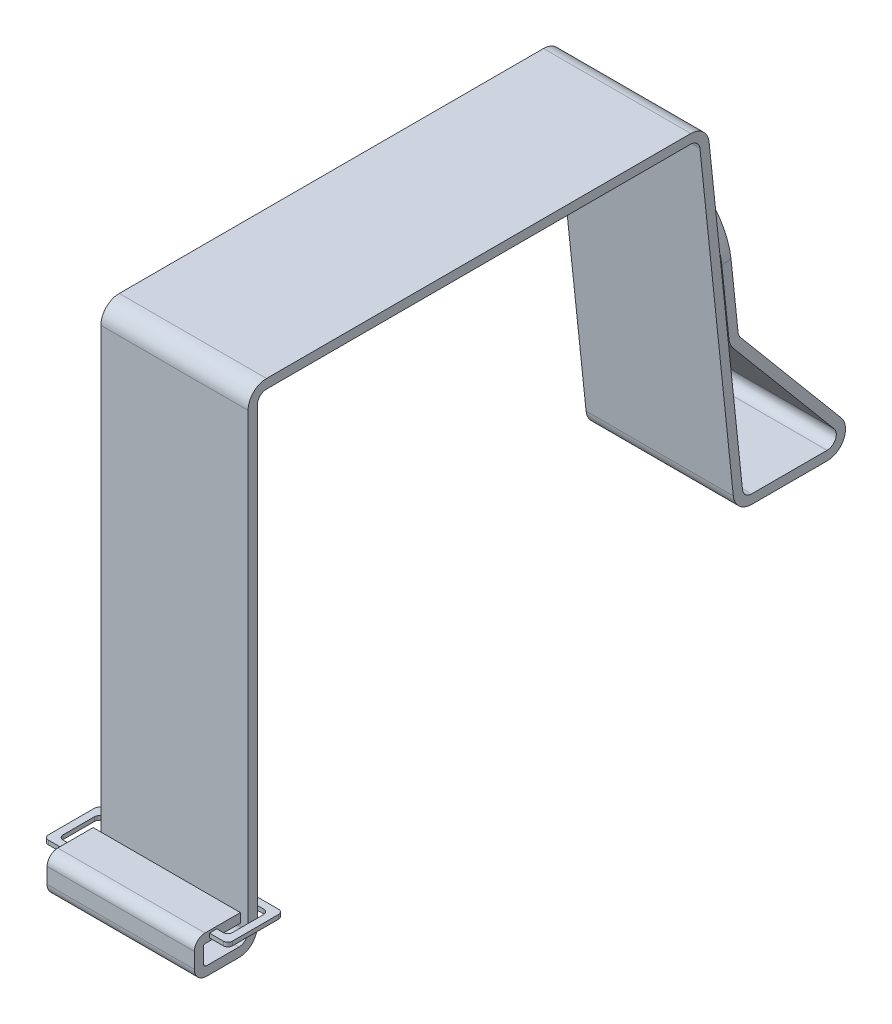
ISO-10303-21;
HEADER;
FILE_DESCRIPTION(('STEP AP214'),'2;1');
FILE_NAME('part.step','',(''),(''),'','','');
FILE_SCHEMA(('AUTOMOTIVE_DESIGN { 1 0 10303 214 1 1 1 1 }'));
ENDSEC;
DATA;
#1=APPLICATION_CONTEXT('core data for automotive mechanical design processes');
#2=APPLICATION_PROTOCOL_DEFINITION('international standard','automotive_design',2000,#1);
#3=PRODUCT_CONTEXT('',#1,'mechanical');
#4=PRODUCT('Part','Part','',(#3));
#5=PRODUCT_RELATED_PRODUCT_CATEGORY('part','',(#4));
#6=PRODUCT_DEFINITION_FORMATION('','',#4);
#7=PRODUCT_DEFINITION_CONTEXT('part definition',#1,'design');
#8=PRODUCT_DEFINITION('design','',#6,#7);
#9=PRODUCT_DEFINITION_SHAPE('','',#8);
#10=(LENGTH_UNIT() NAMED_UNIT(*) SI_UNIT(.MILLI.,.METRE.));
#11=(NAMED_UNIT(*) PLANE_ANGLE_UNIT() SI_UNIT($,.RADIAN.));
#12=(NAMED_UNIT(*) SI_UNIT($,.STERADIAN.) SOLID_ANGLE_UNIT());
#13=UNCERTAINTY_MEASURE_WITH_UNIT(LENGTH_MEASURE(1.E-05),#10,'distance_accuracy_value','');
#14=(GEOMETRIC_REPRESENTATION_CONTEXT(3) GLOBAL_UNCERTAINTY_ASSIGNED_CONTEXT((#13)) GLOBAL_UNIT_ASSIGNED_CONTEXT((#10,
#11,#12)) REPRESENTATION_CONTEXT('',''));
#15=CARTESIAN_POINT('',(0.,0.,0.));
#16=DIRECTION('',(0.,0.,1.));
#17=DIRECTION('',(1.,0.,0.));
#18=AXIS2_PLACEMENT_3D('',#15,#16,#17);
#19=CARTESIAN_POINT('',(25.4,0.,0.));
#20=DIRECTION('',(0.,0.,1.));
#21=DIRECTION('',(1.,0.,0.));
#22=AXIS2_PLACEMENT_3D('',#19,#20,#21);
#23=PLANE('',#22);
#24=DIRECTION('',(-1.,0.,0.));
#25=VECTOR('',#24,1.);
#26=CARTESIAN_POINT('',(-1.905,5.495925,0.));
#27=LINE('',#26,#25);
#28=CARTESIAN_POINT('',(25.4,5.495925,0.));
#29=VERTEX_POINT('',#28);
#30=CARTESIAN_POINT('',(0.,5.495925,0.));
#31=VERTEX_POINT('',#30);
#32=EDGE_CURVE('E1402',#29,#31,#27,.T.);
#33=ORIENTED_EDGE('',*,*,#32,.F.);
#34=DIRECTION('',(0.,1.,0.));
#35=VECTOR('',#34,1.);
#36=CARTESIAN_POINT('',(25.4,0.,0.));
#37=LINE('',#36,#35);
#38=CARTESIAN_POINT('',(25.4,3.175,0.));
#39=VERTEX_POINT('',#38);
#40=EDGE_CURVE('E11',#39,#29,#37,.T.);
#41=ORIENTED_EDGE('',*,*,#40,.F.);
#42=DIRECTION('',(-1.,0.,0.));
#43=VECTOR('',#42,1.);
#44=CARTESIAN_POINT('',(25.4,3.175,0.));
#45=LINE('',#44,#43);
#46=CARTESIAN_POINT('',(0.,3.175,0.));
#47=VERTEX_POINT('',#46);
#48=EDGE_CURVE('E1462',#39,#47,#45,.T.);
#49=ORIENTED_EDGE('',*,*,#48,.T.);
#50=DIRECTION('',(0.,1.,0.));
#51=VECTOR('',#50,1.);
#52=CARTESIAN_POINT('',(0.,0.,0.));
#53=LINE('',#52,#51);
#54=EDGE_CURVE('E392',#47,#31,#53,.T.);
#55=ORIENTED_EDGE('',*,*,#54,.T.);
#56=EDGE_LOOP('',(#33,#41,#49,#55));
#57=FACE_BOUND('',#56,.T.);
#58=ADVANCED_FACE('F17',(#57),#23,.F.);
#59=CARTESIAN_POINT('',(25.4,84.1375,-1.5875));
#60=DIRECTION('',(1.,0.,0.));
#61=DIRECTION('',(0.,1.,0.));
#62=AXIS2_PLACEMENT_3D('',#59,#60,#61);
#63=PLANE('',#62);
#64=DIRECTION('',(0.,0.,-1.));
#65=VECTOR('',#64,1.);
#66=CARTESIAN_POINT('',(25.4,5.495925,2.921));
#67=LINE('',#66,#65);
#68=CARTESIAN_POINT('',(25.4,5.495925,8.255));
#69=VERTEX_POINT('',#68);
#70=CARTESIAN_POINT('',(25.4,5.495925,6.985));
#71=VERTEX_POINT('',#70);
#72=EDGE_CURVE('E1399',#69,#71,#67,.T.);
#73=ORIENTED_EDGE('',*,*,#72,.F.);
#74=DIRECTION('',(0.,1.,0.));
#75=VECTOR('',#74,1.);
#76=CARTESIAN_POINT('',(25.4,6.604,8.255));
#77=LINE('',#76,#75);
#78=CARTESIAN_POINT('',(25.4,6.207125,8.255));
#79=VERTEX_POINT('',#78);
#80=EDGE_CURVE('E1150',#69,#79,#77,.T.);
#81=ORIENTED_EDGE('',*,*,#80,.T.);
#82=DIRECTION('',(0.,0.,-1.));
#83=VECTOR('',#82,1.);
#84=CARTESIAN_POINT('',(25.4,6.207125,2.921));
#85=LINE('',#84,#83);
#86=CARTESIAN_POINT('',(25.4,6.207125,6.985));
#87=VERTEX_POINT('',#86);
#88=EDGE_CURVE('E1267',#79,#87,#85,.T.);
#89=ORIENTED_EDGE('',*,*,#88,.T.);
#90=DIRECTION('',(0.,1.,0.));
#91=VECTOR('',#90,1.);
#92=CARTESIAN_POINT('',(25.4,6.604,6.985));
#93=LINE('',#92,#91);
#94=EDGE_CURVE('E1356',#71,#87,#93,.T.);
#95=ORIENTED_EDGE('',*,*,#94,.F.);
#96=EDGE_LOOP('',(#73,#81,#89,#95));
#97=FACE_BOUND('',#96,.T.);
#98=DIRECTION('',(0.,1.,0.));
#99=VECTOR('',#98,1.);
#100=CARTESIAN_POINT('',(25.4,0.,1.5875));
#101=LINE('',#100,#99);
#102=CARTESIAN_POINT('',(25.4,3.175,1.5875));
#103=VERTEX_POINT('',#102);
#104=CARTESIAN_POINT('',(25.4,80.9625,1.5875));
#105=VERTEX_POINT('',#104);
#106=EDGE_CURVE('E26',#103,#105,#101,.T.);
#107=ORIENTED_EDGE('',*,*,#106,.F.);
#108=CARTESIAN_POINT('',(25.4,3.175,3.175));
#109=DIRECTION('',(1.,0.,0.));
#110=DIRECTION('',(0.,0.,-1.));
#111=AXIS2_PLACEMENT_3D('',#108,#109,#110);
#112=CIRCLE('',#111,1.5875);
#113=CARTESIAN_POINT('',(25.4,1.5875,3.175));
#114=VERTEX_POINT('',#113);
#115=EDGE_CURVE('E1458',#114,#103,#112,.T.);
#116=ORIENTED_EDGE('',*,*,#115,.F.);
#117=DIRECTION('',(0.,0.,1.));
#118=VECTOR('',#117,1.);
#119=CARTESIAN_POINT('',(25.4,1.58749999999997,8.763));
#120=LINE('',#119,#118);
#121=CARTESIAN_POINT('',(25.4,1.58749999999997,8.763));
#122=VERTEX_POINT('',#121);
#123=EDGE_CURVE('E1176',#114,#122,#120,.T.);
#124=ORIENTED_EDGE('',*,*,#123,.T.);
#125=CARTESIAN_POINT('',(25.4,2.09549999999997,8.763));
#126=DIRECTION('',(1.,0.,0.));
#127=DIRECTION('',(0.,0.,-1.));
#128=AXIS2_PLACEMENT_3D('',#125,#126,#127);
#129=CIRCLE('',#128,0.508);
#130=CARTESIAN_POINT('',(25.4,2.09549999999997,9.271));
#131=VERTEX_POINT('',#130);
#132=EDGE_CURVE('E1336',#131,#122,#129,.T.);
#133=ORIENTED_EDGE('',*,*,#132,.F.);
#134=DIRECTION('',(0.,1.,0.));
#135=VECTOR('',#134,1.);
#136=CARTESIAN_POINT('',(25.4,4.7625,9.271));
#137=LINE('',#136,#135);
#138=CARTESIAN_POINT('',(25.4,4.7625,9.271));
#139=VERTEX_POINT('',#138);
#140=EDGE_CURVE('E1286',#131,#139,#137,.T.);
#141=ORIENTED_EDGE('',*,*,#140,.T.);
#142=CARTESIAN_POINT('',(25.4,4.7625,9.017));
#143=DIRECTION('',(1.,0.,0.));
#144=DIRECTION('',(0.,0.,-1.));
#145=AXIS2_PLACEMENT_3D('',#142,#143,#144);
#146=CIRCLE('',#145,0.254);
#147=CARTESIAN_POINT('',(25.4,5.0165,9.017));
#148=VERTEX_POINT('',#147);
#149=EDGE_CURVE('E1197',#148,#139,#146,.T.);
#150=ORIENTED_EDGE('',*,*,#149,.F.);
#151=DIRECTION('',(0.,0.,-1.));
#152=VECTOR('',#151,1.);
#153=CARTESIAN_POINT('',(25.4,5.0165,2.921));
#154=LINE('',#153,#152);
#155=CARTESIAN_POINT('',(25.4,5.0165,2.921));
#156=VERTEX_POINT('',#155);
#157=EDGE_CURVE('E1221',#148,#156,#154,.T.);
#158=ORIENTED_EDGE('',*,*,#157,.T.);
#159=DIRECTION('',(0.,-1.,0.));
#160=VECTOR('',#159,1.);
#161=CARTESIAN_POINT('',(25.4,6.604,2.921));
#162=LINE('',#161,#160);
#163=CARTESIAN_POINT('',(25.4,6.604,2.921));
#164=VERTEX_POINT('',#163);
#165=EDGE_CURVE('E1361',#164,#156,#162,.T.);
#166=ORIENTED_EDGE('',*,*,#165,.F.);
#167=DIRECTION('',(0.,0.,-1.));
#168=VECTOR('',#167,1.);
#169=CARTESIAN_POINT('',(25.4,6.604,0.));
#170=LINE('',#169,#168);
#171=CARTESIAN_POINT('',(25.4,6.604,9.017));
#172=VERTEX_POINT('',#171);
#173=EDGE_CURVE('E1278',#172,#164,#170,.T.);
#174=ORIENTED_EDGE('',*,*,#173,.F.);
#175=CARTESIAN_POINT('',(25.4,4.7625,9.017));
#176=DIRECTION('',(1.,0.,0.));
#177=DIRECTION('',(0.,0.,-1.));
#178=AXIS2_PLACEMENT_3D('',#175,#176,#177);
#179=CIRCLE('',#178,1.8415);
#180=CARTESIAN_POINT('',(25.4,4.7625,10.8585));
#181=VERTEX_POINT('',#180);
#182=EDGE_CURVE('E1145',#172,#181,#179,.T.);
#183=ORIENTED_EDGE('',*,*,#182,.T.);
#184=DIRECTION('',(0.,1.,0.));
#185=VECTOR('',#184,1.);
#186=CARTESIAN_POINT('',(25.4,0.,10.8585));
#187=LINE('',#186,#185);
#188=CARTESIAN_POINT('',(25.4,2.09549999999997,10.8585));
#189=VERTEX_POINT('',#188);
#190=EDGE_CURVE('E1166',#189,#181,#187,.T.);
#191=ORIENTED_EDGE('',*,*,#190,.F.);
#192=CARTESIAN_POINT('',(25.4,2.09549999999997,8.763));
#193=DIRECTION('',(1.,0.,0.));
#194=DIRECTION('',(0.,0.,-1.));
#195=AXIS2_PLACEMENT_3D('',#192,#193,#194);
#196=CIRCLE('',#195,2.0955);
#197=CARTESIAN_POINT('',(25.4,0.,8.763));
#198=VERTEX_POINT('',#197);
#199=EDGE_CURVE('E1439',#189,#198,#196,.T.);
#200=ORIENTED_EDGE('',*,*,#199,.T.);
#201=DIRECTION('',(0.,0.,1.));
#202=VECTOR('',#201,1.);
#203=CARTESIAN_POINT('',(25.4,0.,0.));
#204=LINE('',#203,#202);
#205=CARTESIAN_POINT('',(25.4,0.,3.175));
#206=VERTEX_POINT('',#205);
#207=EDGE_CURVE('E1392',#206,#198,#204,.T.);
#208=ORIENTED_EDGE('',*,*,#207,.F.);
#209=CARTESIAN_POINT('',(25.4,3.175,3.175));
#210=DIRECTION('',(1.,0.,0.));
#211=DIRECTION('',(0.,0.,-1.));
#212=AXIS2_PLACEMENT_3D('',#209,#210,#211);
#213=CIRCLE('',#212,3.175);
#214=EDGE_CURVE('E1466',#206,#39,#213,.T.);
#215=ORIENTED_EDGE('',*,*,#214,.T.);
#216=ORIENTED_EDGE('',*,*,#40,.T.);
#217=DIRECTION('',(0.,1.,0.));
#218=VECTOR('',#217,1.);
#219=CARTESIAN_POINT('',(25.4,84.1375,2.72351585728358E-13));
#220=LINE('',#219,#218);
#221=CARTESIAN_POINT('',(25.4,6.207125,0.));
#222=VERTEX_POINT('',#221);
#223=EDGE_CURVE('E1292',#29,#222,#220,.T.);
#224=ORIENTED_EDGE('',*,*,#223,.T.);
#225=DIRECTION('',(0.,1.,0.));
#226=VECTOR('',#225,1.);
#227=CARTESIAN_POINT('',(25.4,0.,0.));
#228=LINE('',#227,#226);
#229=CARTESIAN_POINT('',(25.4,80.9625,0.));
#230=VERTEX_POINT('',#229);
#231=EDGE_CURVE('E402',#222,#230,#228,.T.);
#232=ORIENTED_EDGE('',*,*,#231,.T.);
#233=CARTESIAN_POINT('',(25.4,80.9625,-1.5875));
#234=DIRECTION('',(-1.,0.,0.));
#235=DIRECTION('',(0.,0.,-1.));
#236=AXIS2_PLACEMENT_3D('',#233,#234,#235);
#237=CIRCLE('',#236,1.5875);
#238=CARTESIAN_POINT('',(25.4,82.55,-1.5875));
#239=VERTEX_POINT('',#238);
#240=EDGE_CURVE('E1517',#230,#239,#237,.T.);
#241=ORIENTED_EDGE('',*,*,#240,.T.);
#242=DIRECTION('',(0.,0.,-1.));
#243=VECTOR('',#242,1.);
#244=CARTESIAN_POINT('',(25.4,82.55,0.));
#245=LINE('',#244,#243);
#246=CARTESIAN_POINT('',(25.4,82.55,-74.7706085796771));
#247=VERTEX_POINT('',#246);
#248=EDGE_CURVE('E1168',#239,#247,#245,.T.);
#249=ORIENTED_EDGE('',*,*,#248,.T.);
#250=CARTESIAN_POINT('',(25.4,80.9625,-74.7706085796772));
#251=DIRECTION('',(-1.,0.,0.));
#252=DIRECTION('',(0.,0.,-1.));
#253=AXIS2_PLACEMENT_3D('',#250,#251,#252);
#254=CIRCLE('',#253,1.5875);
#255=CARTESIAN_POINT('',(25.4,81.1284389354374,-76.3494120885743));
#256=VERTEX_POINT('',#255);
#257=EDGE_CURVE('E1407',#247,#256,#254,.T.);
#258=ORIENTED_EDGE('',*,*,#257,.T.);
#259=DIRECTION('',(0.,-0.994521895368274,-0.10452846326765));
#260=VECTOR('',#259,1.);
#261=CARTESIAN_POINT('',(25.4,82.55,-76.2));
#262=LINE('',#261,#260);
#263=CARTESIAN_POINT('',(25.4,26.3135610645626,-82.1106879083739));
#264=VERTEX_POINT('',#263);
#265=EDGE_CURVE('E387',#256,#264,#262,.T.);
#266=ORIENTED_EDGE('',*,*,#265,.T.);
#267=CARTESIAN_POINT('',(25.4,26.6454389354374,-85.2682949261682));
#268=DIRECTION('',(1.,0.,0.));
#269=DIRECTION('',(0.,0.,1.));
#270=AXIS2_PLACEMENT_3D('',#267,#268,#269);
#271=CIRCLE('',#270,3.175);
#272=CARTESIAN_POINT('',(25.4,23.4704389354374,-85.2682949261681));
#273=VERTEX_POINT('',#272);
#274=EDGE_CURVE('E1374',#264,#273,#271,.T.);
#275=ORIENTED_EDGE('',*,*,#274,.T.);
#276=DIRECTION('',(0.,0.,1.));
#277=VECTOR('',#276,1.);
#278=CARTESIAN_POINT('',(25.4,23.470438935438,0.166852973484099));
#279=LINE('',#278,#277);
#280=CARTESIAN_POINT('',(25.4,23.4704389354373,-98.2845120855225));
#281=VERTEX_POINT('',#280);
#282=EDGE_CURVE('E1254',#281,#273,#279,.T.);
#283=ORIENTED_EDGE('',*,*,#282,.F.);
#284=CARTESIAN_POINT('',(25.4,26.6454389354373,-98.2845120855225));
#285=DIRECTION('',(1.,0.,0.));
#286=DIRECTION('',(0.,0.,1.));
#287=AXIS2_PLACEMENT_3D('',#284,#285,#286);
#288=CIRCLE('',#287,3.175);
#289=CARTESIAN_POINT('',(25.4,28.6862895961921,-100.716703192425));
#290=VERTEX_POINT('',#289);
#291=EDGE_CURVE('E1575',#281,#290,#288,.T.);
#292=ORIENTED_EDGE('',*,*,#291,.T.);
#293=DIRECTION('',(0.,-0.766044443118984,-0.642787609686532));
#294=VECTOR('',#293,1.);
#295=CARTESIAN_POINT('',(25.4,59.769436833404,-74.6348458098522));
#296=LINE('',#295,#294);
#297=CARTESIAN_POINT('',(25.4,49.4462399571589,-83.2970365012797));
#298=VERTEX_POINT('',#297);
#299=EDGE_CURVE('E1533',#298,#290,#296,.T.);
#300=ORIENTED_EDGE('',*,*,#299,.F.);
#301=CARTESIAN_POINT('',(25.4,50.4666652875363,-84.5131320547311));
#302=DIRECTION('',(1.,0.,0.));
#303=DIRECTION('',(0.,0.,-1.));
#304=AXIS2_PLACEMENT_3D('',#301,#302,#303);
#305=CIRCLE('',#304,1.5875);
#306=CARTESIAN_POINT('',(25.4,50.3007263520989,-82.934328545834));
#307=VERTEX_POINT('',#306);
#308=EDGE_CURVE('E1685',#307,#298,#305,.T.);
#309=ORIENTED_EDGE('',*,*,#308,.F.);
#310=DIRECTION('',(0.,0.994521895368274,0.10452846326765));
#311=VECTOR('',#310,1.);
#312=CARTESIAN_POINT('',(25.4,74.5962051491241,-80.3807708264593));
#313=LINE('',#312,#311);
#314=CARTESIAN_POINT('',(25.4,61.9657770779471,-81.7082823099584));
#315=VERTEX_POINT('',#314);
#316=EDGE_CURVE('E1709',#307,#315,#313,.T.);
#317=ORIENTED_EDGE('',*,*,#316,.T.);
#318=DIRECTION('',(0.,-0.10452846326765,0.994521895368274));
#319=VECTOR('',#318,1.);
#320=CARTESIAN_POINT('',(25.4,61.7998381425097,-80.1294788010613));
#321=LINE('',#320,#319);
#322=CARTESIAN_POINT('',(25.4,61.7998381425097,-80.1294788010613));
#323=VERTEX_POINT('',#322);
#324=EDGE_CURVE('E1749',#315,#323,#321,.T.);
#325=ORIENTED_EDGE('',*,*,#324,.T.);
#326=DIRECTION('',(0.,0.994521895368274,0.10452846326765));
#327=VECTOR('',#326,1.);
#328=CARTESIAN_POINT('',(25.4,9.40533212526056,-85.6363632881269));
#329=LINE('',#328,#327);
#330=CARTESIAN_POINT('',(25.4,50.1347874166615,-81.3555250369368));
#331=VERTEX_POINT('',#330);
#332=EDGE_CURVE('E1697',#331,#323,#329,.T.);
#333=ORIENTED_EDGE('',*,*,#332,.F.);
#334=CARTESIAN_POINT('',(25.4,50.4666652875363,-84.5131320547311));
#335=DIRECTION('',(1.,0.,0.));
#336=DIRECTION('',(0.,0.,-1.));
#337=AXIS2_PLACEMENT_3D('',#334,#335,#336);
#338=CIRCLE('',#337,3.175);
#339=CARTESIAN_POINT('',(25.4,48.4258146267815,-82.0809409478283));
#340=VERTEX_POINT('',#339);
#341=EDGE_CURVE('E1541',#331,#340,#338,.T.);
#342=ORIENTED_EDGE('',*,*,#341,.T.);
#343=DIRECTION('',(0.,-0.766044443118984,-0.642787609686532));
#344=VECTOR('',#343,1.);
#345=CARTESIAN_POINT('',(25.4,25.0579389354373,-101.688916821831));
#346=LINE('',#345,#344);
#347=CARTESIAN_POINT('',(25.4,27.6658642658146,-99.5006076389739));
#348=VERTEX_POINT('',#347);
#349=EDGE_CURVE('E1566',#340,#348,#346,.T.);
#350=ORIENTED_EDGE('',*,*,#349,.T.);
#351=CARTESIAN_POINT('',(25.4,26.6454389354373,-98.2845120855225));
#352=DIRECTION('',(1.,0.,0.));
#353=DIRECTION('',(0.,0.,1.));
#354=AXIS2_PLACEMENT_3D('',#351,#352,#353);
#355=CIRCLE('',#354,1.58750000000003);
#356=CARTESIAN_POINT('',(25.4,25.0579389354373,-98.2845120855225));
#357=VERTEX_POINT('',#356);
#358=EDGE_CURVE('E1580',#357,#348,#355,.T.);
#359=ORIENTED_EDGE('',*,*,#358,.F.);
#360=DIRECTION('',(0.,0.,1.));
#361=VECTOR('',#360,1.);
#362=CARTESIAN_POINT('',(25.4,25.0579389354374,-83.8389035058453));
#363=LINE('',#362,#361);
#364=CARTESIAN_POINT('',(25.4,25.0579389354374,-85.2682949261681));
#365=VERTEX_POINT('',#364);
#366=EDGE_CURVE('E1477',#357,#365,#363,.T.);
#367=ORIENTED_EDGE('',*,*,#366,.T.);
#368=CARTESIAN_POINT('',(25.4,26.6454389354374,-85.2682949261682));
#369=DIRECTION('',(1.,0.,0.));
#370=DIRECTION('',(0.,0.,1.));
#371=AXIS2_PLACEMENT_3D('',#368,#369,#370);
#372=CIRCLE('',#371,1.5875);
#373=CARTESIAN_POINT('',(25.4,26.4795,-83.689491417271));
#374=VERTEX_POINT('',#373);
#375=EDGE_CURVE('E1296',#374,#365,#372,.T.);
#376=ORIENTED_EDGE('',*,*,#375,.F.);
#377=DIRECTION('',(0.,-0.994521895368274,-0.10452846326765));
#378=VECTOR('',#377,1.);
#379=CARTESIAN_POINT('',(25.4,82.7159389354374,-77.7788035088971));
#380=LINE('',#379,#378);
#381=CARTESIAN_POINT('',(25.4,81.2943778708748,-77.9282155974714));
#382=VERTEX_POINT('',#381);
#383=EDGE_CURVE('E39',#382,#374,#380,.T.);
#384=ORIENTED_EDGE('',*,*,#383,.F.);
#385=CARTESIAN_POINT('',(25.4,80.9625,-74.7706085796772));
#386=DIRECTION('',(-1.,0.,0.));
#387=DIRECTION('',(0.,0.,-1.));
#388=AXIS2_PLACEMENT_3D('',#385,#386,#387);
#389=CIRCLE('',#388,3.175);
#390=CARTESIAN_POINT('',(25.4,84.1375,-74.770608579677));
#391=VERTEX_POINT('',#390);
#392=EDGE_CURVE('E340',#391,#382,#389,.T.);
#393=ORIENTED_EDGE('',*,*,#392,.F.);
#394=DIRECTION('',(0.,0.,-1.));
#395=VECTOR('',#394,1.);
#396=CARTESIAN_POINT('',(25.4,84.1375,0.));
#397=LINE('',#396,#395);
#398=CARTESIAN_POINT('',(25.4,84.1375,-1.5875));
#399=VERTEX_POINT('',#398);
#400=EDGE_CURVE('E333',#399,#391,#397,.T.);
#401=ORIENTED_EDGE('',*,*,#400,.F.);
#402=CARTESIAN_POINT('',(25.4,80.9625,-1.5875));
#403=DIRECTION('',(-1.,0.,0.));
#404=DIRECTION('',(0.,0.,-1.));
#405=AXIS2_PLACEMENT_3D('',#402,#403,#404);
#406=CIRCLE('',#405,3.175);
#407=EDGE_CURVE('E337',#105,#399,#406,.T.);
#408=ORIENTED_EDGE('',*,*,#407,.F.);
#409=EDGE_LOOP('',(#107,#116,#124,#133,#141,#150,#158,#166,#174,#183,#191,#200,#208,#215,#216,
#224,#232,#241,#249,#258,#266,#275,#283,#292,#300,#309,#317,#325,#333,#342,#350,#359,#367,#376,
#384,#393,#401,#408));
#410=FACE_BOUND('',#409,.T.);
#411=ADVANCED_FACE('F335',(#97,#410),#63,.T.);
#412=CARTESIAN_POINT('',(25.4,0.,1.5875));
#413=DIRECTION('',(0.,0.,1.));
#414=DIRECTION('',(1.,0.,0.));
#415=AXIS2_PLACEMENT_3D('',#412,#413,#414);
#416=PLANE('',#415);
#417=DIRECTION('',(0.,1.,0.));
#418=VECTOR('',#417,1.);
#419=CARTESIAN_POINT('',(0.,0.,1.5875));
#420=LINE('',#419,#418);
#421=CARTESIAN_POINT('',(0.,3.175,1.5875));
#422=VERTEX_POINT('',#421);
#423=CARTESIAN_POINT('',(0.,80.9625,1.5875));
#424=VERTEX_POINT('',#423);
#425=EDGE_CURVE('E395',#422,#424,#420,.T.);
#426=ORIENTED_EDGE('',*,*,#425,.F.);
#427=DIRECTION('',(-1.,0.,0.));
#428=VECTOR('',#427,1.);
#429=CARTESIAN_POINT('',(25.4,3.175,1.5875));
#430=LINE('',#429,#428);
#431=EDGE_CURVE('E1451',#103,#422,#430,.T.);
#432=ORIENTED_EDGE('',*,*,#431,.F.);
#433=ORIENTED_EDGE('',*,*,#106,.T.);
#434=DIRECTION('',(-1.,0.,0.));
#435=VECTOR('',#434,1.);
#436=CARTESIAN_POINT('',(25.4,80.9625,1.5875));
#437=LINE('',#436,#435);
#438=EDGE_CURVE('E358',#105,#424,#437,.T.);
#439=ORIENTED_EDGE('',*,*,#438,.T.);
#440=EDGE_LOOP('',(#426,#432,#433,#439));
#441=FACE_BOUND('',#440,.T.);
#442=ADVANCED_FACE('F874',(#441),#416,.T.);
#443=CARTESIAN_POINT('',(25.4,0.,0.));
#444=DIRECTION('',(0.,0.,1.));
#445=DIRECTION('',(1.,0.,0.));
#446=AXIS2_PLACEMENT_3D('',#443,#444,#445);
#447=PLANE('',#446);
#448=ORIENTED_EDGE('',*,*,#231,.F.);
#449=DIRECTION('',(-1.,0.,0.));
#450=VECTOR('',#449,1.);
#451=CARTESIAN_POINT('',(-1.905,6.207125,0.));
#452=LINE('',#451,#450);
#453=CARTESIAN_POINT('',(0.,6.207125,0.));
#454=VERTEX_POINT('',#453);
#455=EDGE_CURVE('E1271',#222,#454,#452,.T.);
#456=ORIENTED_EDGE('',*,*,#455,.T.);
#457=DIRECTION('',(0.,1.,0.));
#458=VECTOR('',#457,1.);
#459=CARTESIAN_POINT('',(0.,0.,0.));
#460=LINE('',#459,#458);
#461=CARTESIAN_POINT('',(0.,80.9625,0.));
#462=VERTEX_POINT('',#461);
#463=EDGE_CURVE('E399',#454,#462,#460,.T.);
#464=ORIENTED_EDGE('',*,*,#463,.T.);
#465=DIRECTION('',(-1.,0.,0.));
#466=VECTOR('',#465,1.);
#467=CARTESIAN_POINT('',(25.4,80.9625,0.));
#468=LINE('',#467,#466);
#469=EDGE_CURVE('E1419',#230,#462,#468,.T.);
#470=ORIENTED_EDGE('',*,*,#469,.F.);
#471=EDGE_LOOP('',(#448,#456,#464,#470));
#472=FACE_BOUND('',#471,.T.);
#473=ADVANCED_FACE('F866',(#472),#447,.F.);
#474=CARTESIAN_POINT('',(0.,80.9625,-74.7706085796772));
#475=DIRECTION('',(1.,0.,0.));
#476=DIRECTION('',(0.,1.,0.));
#477=AXIS2_PLACEMENT_3D('',#474,#475,#476);
#478=PLANE('',#477);
#479=DIRECTION('',(0.,0.,1.));
#480=VECTOR('',#479,1.);
#481=CARTESIAN_POINT('',(0.,6.207125,9.271));
#482=LINE('',#481,#480);
#483=CARTESIAN_POINT('',(0.,6.207125,6.985));
#484=VERTEX_POINT('',#483);
#485=CARTESIAN_POINT('',(0.,6.207125,8.255));
#486=VERTEX_POINT('',#485);
#487=EDGE_CURVE('E1369',#484,#486,#482,.T.);
#488=ORIENTED_EDGE('',*,*,#487,.T.);
#489=DIRECTION('',(0.,-1.,0.));
#490=VECTOR('',#489,1.);
#491=CARTESIAN_POINT('',(0.,6.604,8.255));
#492=LINE('',#491,#490);
#493=CARTESIAN_POINT('',(0.,5.495925,8.255));
#494=VERTEX_POINT('',#493);
#495=EDGE_CURVE('E1154',#486,#494,#492,.T.);
#496=ORIENTED_EDGE('',*,*,#495,.T.);
#497=DIRECTION('',(0.,0.,1.));
#498=VECTOR('',#497,1.);
#499=CARTESIAN_POINT('',(0.,5.495925,9.271));
#500=LINE('',#499,#498);
#501=CARTESIAN_POINT('',(0.,5.495925,6.985));
#502=VERTEX_POINT('',#501);
#503=EDGE_CURVE('E1327',#502,#494,#500,.T.);
#504=ORIENTED_EDGE('',*,*,#503,.F.);
#505=DIRECTION('',(0.,-1.,0.));
#506=VECTOR('',#505,1.);
#507=CARTESIAN_POINT('',(0.,6.604,6.985));
#508=LINE('',#507,#506);
#509=EDGE_CURVE('E1313',#484,#502,#508,.T.);
#510=ORIENTED_EDGE('',*,*,#509,.F.);
#511=EDGE_LOOP('',(#488,#496,#504,#510));
#512=FACE_BOUND('',#511,.T.);
#513=ORIENTED_EDGE('',*,*,#54,.F.);
#514=CARTESIAN_POINT('',(0.,3.175,3.175));
#515=DIRECTION('',(-1.,0.,0.));
#516=DIRECTION('',(0.,0.,-1.));
#517=AXIS2_PLACEMENT_3D('',#514,#515,#516);
#518=CIRCLE('',#517,3.175);
#519=CARTESIAN_POINT('',(0.,0.,3.175));
#520=VERTEX_POINT('',#519);
#521=EDGE_CURVE('E1470',#47,#520,#518,.T.);
#522=ORIENTED_EDGE('',*,*,#521,.T.);
#523=DIRECTION('',(0.,0.,-1.));
#524=VECTOR('',#523,1.);
#525=CARTESIAN_POINT('',(0.,0.,0.));
#526=LINE('',#525,#524);
#527=CARTESIAN_POINT('',(0.,0.,8.763));
#528=VERTEX_POINT('',#527);
#529=EDGE_CURVE('E1450',#528,#520,#526,.T.);
#530=ORIENTED_EDGE('',*,*,#529,.F.);
#531=CARTESIAN_POINT('',(0.,2.09549999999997,8.763));
#532=DIRECTION('',(-1.,0.,0.));
#533=DIRECTION('',(0.,0.,-1.));
#534=AXIS2_PLACEMENT_3D('',#531,#532,#533);
#535=CIRCLE('',#534,2.0955);
#536=CARTESIAN_POINT('',(0.,2.09549999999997,10.8585));
#537=VERTEX_POINT('',#536);
#538=EDGE_CURVE('E1180',#528,#537,#535,.T.);
#539=ORIENTED_EDGE('',*,*,#538,.T.);
#540=DIRECTION('',(0.,-1.,0.));
#541=VECTOR('',#540,1.);
#542=CARTESIAN_POINT('',(0.,0.,10.8585));
#543=LINE('',#542,#541);
#544=CARTESIAN_POINT('',(0.,4.7625,10.8585));
#545=VERTEX_POINT('',#544);
#546=EDGE_CURVE('E1396',#545,#537,#543,.T.);
#547=ORIENTED_EDGE('',*,*,#546,.F.);
#548=CARTESIAN_POINT('',(0.,4.7625,9.017));
#549=DIRECTION('',(-1.,0.,0.));
#550=DIRECTION('',(0.,0.,-1.));
#551=AXIS2_PLACEMENT_3D('',#548,#549,#550);
#552=CIRCLE('',#551,1.8415);
#553=CARTESIAN_POINT('',(0.,6.604,9.017));
#554=VERTEX_POINT('',#553);
#555=EDGE_CURVE('E1147',#545,#554,#552,.T.);
#556=ORIENTED_EDGE('',*,*,#555,.T.);
#557=DIRECTION('',(0.,0.,1.));
#558=VECTOR('',#557,1.);
#559=CARTESIAN_POINT('',(0.,6.604,0.));
#560=LINE('',#559,#558);
#561=CARTESIAN_POINT('',(0.,6.604,2.921));
#562=VERTEX_POINT('',#561);
#563=EDGE_CURVE('E1240',#562,#554,#560,.T.);
#564=ORIENTED_EDGE('',*,*,#563,.F.);
#565=DIRECTION('',(0.,-1.,0.));
#566=VECTOR('',#565,1.);
#567=CARTESIAN_POINT('',(0.,6.604,2.921));
#568=LINE('',#567,#566);
#569=CARTESIAN_POINT('',(0.,5.0165,2.921));
#570=VERTEX_POINT('',#569);
#571=EDGE_CURVE('E1427',#562,#570,#568,.T.);
#572=ORIENTED_EDGE('',*,*,#571,.T.);
#573=DIRECTION('',(0.,0.,1.));
#574=VECTOR('',#573,1.);
#575=CARTESIAN_POINT('',(0.,5.0165,9.271));
#576=LINE('',#575,#574);
#577=CARTESIAN_POINT('',(0.,5.0165,9.017));
#578=VERTEX_POINT('',#577);
#579=EDGE_CURVE('E1220',#570,#578,#576,.T.);
#580=ORIENTED_EDGE('',*,*,#579,.T.);
#581=CARTESIAN_POINT('',(0.,4.7625,9.017));
#582=DIRECTION('',(-1.,0.,0.));
#583=DIRECTION('',(0.,0.,-1.));
#584=AXIS2_PLACEMENT_3D('',#581,#582,#583);
#585=CIRCLE('',#584,0.254);
#586=CARTESIAN_POINT('',(0.,4.7625,9.271));
#587=VERTEX_POINT('',#586);
#588=EDGE_CURVE('E1239',#587,#578,#585,.T.);
#589=ORIENTED_EDGE('',*,*,#588,.F.);
#590=DIRECTION('',(0.,-1.,0.));
#591=VECTOR('',#590,1.);
#592=CARTESIAN_POINT('',(0.,1.58749999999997,9.271));
#593=LINE('',#592,#591);
#594=CARTESIAN_POINT('',(0.,2.09549999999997,9.271));
#595=VERTEX_POINT('',#594);
#596=EDGE_CURVE('E1167',#587,#595,#593,.T.);
#597=ORIENTED_EDGE('',*,*,#596,.T.);
#598=CARTESIAN_POINT('',(0.,2.09549999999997,8.763));
#599=DIRECTION('',(-1.,0.,0.));
#600=DIRECTION('',(0.,0.,-1.));
#601=AXIS2_PLACEMENT_3D('',#598,#599,#600);
#602=CIRCLE('',#601,0.508);
#603=CARTESIAN_POINT('',(0.,1.58749999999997,8.763));
#604=VERTEX_POINT('',#603);
#605=EDGE_CURVE('E1341',#604,#595,#602,.T.);
#606=ORIENTED_EDGE('',*,*,#605,.F.);
#607=DIRECTION('',(0.,0.,-1.));
#608=VECTOR('',#607,1.);
#609=CARTESIAN_POINT('',(0.,1.5875,1.5875));
#610=LINE('',#609,#608);
#611=CARTESIAN_POINT('',(0.,1.5875,3.175));
#612=VERTEX_POINT('',#611);
#613=EDGE_CURVE('E1393',#604,#612,#610,.T.);
#614=ORIENTED_EDGE('',*,*,#613,.T.);
#615=CARTESIAN_POINT('',(0.,3.175,3.175));
#616=DIRECTION('',(-1.,0.,0.));
#617=DIRECTION('',(0.,0.,-1.));
#618=AXIS2_PLACEMENT_3D('',#615,#616,#617);
#619=CIRCLE('',#618,1.5875);
#620=EDGE_CURVE('E1455',#422,#612,#619,.T.);
#621=ORIENTED_EDGE('',*,*,#620,.F.);
#622=ORIENTED_EDGE('',*,*,#425,.T.);
#623=CARTESIAN_POINT('',(0.,80.9625,-1.5875));
#624=DIRECTION('',(-1.,0.,0.));
#625=DIRECTION('',(0.,0.,-1.));
#626=AXIS2_PLACEMENT_3D('',#623,#624,#625);
#627=CIRCLE('',#626,3.175);
#628=CARTESIAN_POINT('',(0.,84.1375,-1.5875));
#629=VERTEX_POINT('',#628);
#630=EDGE_CURVE('E363',#424,#629,#627,.T.);
#631=ORIENTED_EDGE('',*,*,#630,.T.);
#632=DIRECTION('',(0.,0.,-1.));
#633=VECTOR('',#632,1.);
#634=CARTESIAN_POINT('',(0.,84.1375,0.));
#635=LINE('',#634,#633);
#636=CARTESIAN_POINT('',(0.,84.1375,-74.770608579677));
#637=VERTEX_POINT('',#636);
#638=EDGE_CURVE('E346',#629,#637,#635,.T.);
#639=ORIENTED_EDGE('',*,*,#638,.T.);
#640=CARTESIAN_POINT('',(0.,80.9625,-74.7706085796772));
#641=DIRECTION('',(-1.,0.,0.));
#642=DIRECTION('',(0.,0.,-1.));
#643=AXIS2_PLACEMENT_3D('',#640,#641,#642);
#644=CIRCLE('',#643,3.175);
#645=CARTESIAN_POINT('',(0.,81.2943778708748,-77.9282155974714));
#646=VERTEX_POINT('',#645);
#647=EDGE_CURVE('E371',#637,#646,#644,.T.);
#648=ORIENTED_EDGE('',*,*,#647,.T.);
#649=DIRECTION('',(0.,-0.994521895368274,-0.10452846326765));
#650=VECTOR('',#649,1.);
#651=CARTESIAN_POINT('',(0.,82.7159389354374,-77.7788035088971));
#652=LINE('',#651,#650);
#653=CARTESIAN_POINT('',(0.,26.4795,-83.689491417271));
#654=VERTEX_POINT('',#653);
#655=EDGE_CURVE('E383',#646,#654,#652,.T.);
#656=ORIENTED_EDGE('',*,*,#655,.T.);
#657=CARTESIAN_POINT('',(0.,26.6454389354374,-85.2682949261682));
#658=DIRECTION('',(-1.,0.,0.));
#659=DIRECTION('',(0.,0.,1.));
#660=AXIS2_PLACEMENT_3D('',#657,#658,#659);
#661=CIRCLE('',#660,1.5875);
#662=CARTESIAN_POINT('',(0.,25.0579389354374,-85.2682949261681));
#663=VERTEX_POINT('',#662);
#664=EDGE_CURVE('E1489',#663,#654,#661,.T.);
#665=ORIENTED_EDGE('',*,*,#664,.F.);
#666=DIRECTION('',(0.,0.,-1.));
#667=VECTOR('',#666,1.);
#668=CARTESIAN_POINT('',(0.,25.0579389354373,-98.2845120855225));
#669=LINE('',#668,#667);
#670=CARTESIAN_POINT('',(0.,25.0579389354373,-98.2845120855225));
#671=VERTEX_POINT('',#670);
#672=EDGE_CURVE('E1473',#663,#671,#669,.T.);
#673=ORIENTED_EDGE('',*,*,#672,.T.);
#674=CARTESIAN_POINT('',(0.,26.6454389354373,-98.2845120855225));
#675=DIRECTION('',(-1.,0.,0.));
#676=DIRECTION('',(0.,0.,1.));
#677=AXIS2_PLACEMENT_3D('',#674,#675,#676);
#678=CIRCLE('',#677,1.58750000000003);
#679=CARTESIAN_POINT('',(0.,27.6658642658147,-99.5006076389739));
#680=VERTEX_POINT('',#679);
#681=EDGE_CURVE('E1583',#680,#671,#678,.T.);
#682=ORIENTED_EDGE('',*,*,#681,.F.);
#683=DIRECTION('',(0.,0.766044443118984,0.642787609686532));
#684=VECTOR('',#683,1.);
#685=CARTESIAN_POINT('',(0.,48.4258146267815,-82.0809409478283));
#686=LINE('',#685,#684);
#687=CARTESIAN_POINT('',(0.,48.4258146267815,-82.0809409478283));
#688=VERTEX_POINT('',#687);
#689=EDGE_CURVE('E1547',#680,#688,#686,.T.);
#690=ORIENTED_EDGE('',*,*,#689,.T.);
#691=CARTESIAN_POINT('',(0.,50.4666652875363,-84.5131320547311));
#692=DIRECTION('',(-1.,0.,0.));
#693=DIRECTION('',(0.,0.,-1.));
#694=AXIS2_PLACEMENT_3D('',#691,#692,#693);
#695=CIRCLE('',#694,3.175);
#696=CARTESIAN_POINT('',(0.,50.1347874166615,-81.3555250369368));
#697=VERTEX_POINT('',#696);
#698=EDGE_CURVE('E1545',#688,#697,#695,.T.);
#699=ORIENTED_EDGE('',*,*,#698,.T.);
#700=DIRECTION('',(0.,-0.994521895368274,-0.10452846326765));
#701=VECTOR('',#700,1.);
#702=CARTESIAN_POINT('',(0.,9.40533212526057,-85.6363632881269));
#703=LINE('',#702,#701);
#704=CARTESIAN_POINT('',(0.,61.7998381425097,-80.1294788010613));
#705=VERTEX_POINT('',#704);
#706=EDGE_CURVE('E1699',#705,#697,#703,.T.);
#707=ORIENTED_EDGE('',*,*,#706,.F.);
#708=DIRECTION('',(0.,0.10452846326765,-0.994521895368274));
#709=VECTOR('',#708,1.);
#710=CARTESIAN_POINT('',(0.,61.7998381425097,-80.1294788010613));
#711=LINE('',#710,#709);
#712=CARTESIAN_POINT('',(0.,61.9657770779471,-81.7082823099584));
#713=VERTEX_POINT('',#712);
#714=EDGE_CURVE('E1736',#705,#713,#711,.T.);
#715=ORIENTED_EDGE('',*,*,#714,.T.);
#716=DIRECTION('',(0.,-0.994521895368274,-0.10452846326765));
#717=VECTOR('',#716,1.);
#718=CARTESIAN_POINT('',(0.,49.8180376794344,-82.9850611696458));
#719=LINE('',#718,#717);
#720=CARTESIAN_POINT('',(0.,50.3007263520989,-82.934328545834));
#721=VERTEX_POINT('',#720);
#722=EDGE_CURVE('E1712',#713,#721,#719,.T.);
#723=ORIENTED_EDGE('',*,*,#722,.T.);
#724=CARTESIAN_POINT('',(0.,50.4666652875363,-84.5131320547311));
#725=DIRECTION('',(-1.,0.,0.));
#726=DIRECTION('',(0.,0.,-1.));
#727=AXIS2_PLACEMENT_3D('',#724,#725,#726);
#728=CIRCLE('',#727,1.5875);
#729=CARTESIAN_POINT('',(0.,49.4462399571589,-83.2970365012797));
#730=VERTEX_POINT('',#729);
#731=EDGE_CURVE('E1686',#730,#721,#728,.T.);
#732=ORIENTED_EDGE('',*,*,#731,.F.);
#733=DIRECTION('',(0.,0.766044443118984,0.642787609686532));
#734=VECTOR('',#733,1.);
#735=CARTESIAN_POINT('',(0.,59.769436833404,-74.6348458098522));
#736=LINE('',#735,#734);
#737=CARTESIAN_POINT('',(0.,28.6862895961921,-100.716703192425));
#738=VERTEX_POINT('',#737);
#739=EDGE_CURVE('E1537',#738,#730,#736,.T.);
#740=ORIENTED_EDGE('',*,*,#739,.F.);
#741=CARTESIAN_POINT('',(0.,26.6454389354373,-98.2845120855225));
#742=DIRECTION('',(-1.,0.,0.));
#743=DIRECTION('',(0.,0.,1.));
#744=AXIS2_PLACEMENT_3D('',#741,#742,#743);
#745=CIRCLE('',#744,3.175);
#746=CARTESIAN_POINT('',(0.,23.4704389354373,-98.2845120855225));
#747=VERTEX_POINT('',#746);
#748=EDGE_CURVE('E1571',#738,#747,#745,.T.);
#749=ORIENTED_EDGE('',*,*,#748,.T.);
#750=DIRECTION('',(0.,0.,-1.));
#751=VECTOR('',#750,1.);
#752=CARTESIAN_POINT('',(0.,23.470438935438,0.166852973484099));
#753=LINE('',#752,#751);
#754=CARTESIAN_POINT('',(0.,23.4704389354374,-85.2682949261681));
#755=VERTEX_POINT('',#754);
#756=EDGE_CURVE('E1259',#755,#747,#753,.T.);
#757=ORIENTED_EDGE('',*,*,#756,.F.);
#758=CARTESIAN_POINT('',(0.,26.6454389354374,-85.2682949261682));
#759=DIRECTION('',(-1.,0.,0.));
#760=DIRECTION('',(0.,0.,1.));
#761=AXIS2_PLACEMENT_3D('',#758,#759,#760);
#762=CIRCLE('',#761,3.175);
#763=CARTESIAN_POINT('',(0.,26.3135610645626,-82.1106879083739));
#764=VERTEX_POINT('',#763);
#765=EDGE_CURVE('E1378',#755,#764,#762,.T.);
#766=ORIENTED_EDGE('',*,*,#765,.T.);
#767=DIRECTION('',(0.,-0.994521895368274,-0.10452846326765));
#768=VECTOR('',#767,1.);
#769=CARTESIAN_POINT('',(0.,82.55,-76.2));
#770=LINE('',#769,#768);
#771=CARTESIAN_POINT('',(0.,81.1284389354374,-76.3494120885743));
#772=VERTEX_POINT('',#771);
#773=EDGE_CURVE('E391',#772,#764,#770,.T.);
#774=ORIENTED_EDGE('',*,*,#773,.F.);
#775=CARTESIAN_POINT('',(0.,80.9625,-74.7706085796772));
#776=DIRECTION('',(-1.,0.,0.));
#777=DIRECTION('',(0.,0.,-1.));
#778=AXIS2_PLACEMENT_3D('',#775,#776,#777);
#779=CIRCLE('',#778,1.5875);
#780=CARTESIAN_POINT('',(0.,82.55,-74.7706085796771));
#781=VERTEX_POINT('',#780);
#782=EDGE_CURVE('E1377',#781,#772,#779,.T.);
#783=ORIENTED_EDGE('',*,*,#782,.F.);
#784=DIRECTION('',(0.,0.,-1.));
#785=VECTOR('',#784,1.);
#786=CARTESIAN_POINT('',(0.,82.55,0.));
#787=LINE('',#786,#785);
#788=CARTESIAN_POINT('',(0.,82.55,-1.5875));
#789=VERTEX_POINT('',#788);
#790=EDGE_CURVE('E1172',#789,#781,#787,.T.);
#791=ORIENTED_EDGE('',*,*,#790,.F.);
#792=CARTESIAN_POINT('',(0.,80.9625,-1.5875));
#793=DIRECTION('',(-1.,0.,0.));
#794=DIRECTION('',(0.,0.,-1.));
#795=AXIS2_PLACEMENT_3D('',#792,#793,#794);
#796=CIRCLE('',#795,1.5875);
#797=EDGE_CURVE('E1515',#462,#789,#796,.T.);
#798=ORIENTED_EDGE('',*,*,#797,.F.);
#799=ORIENTED_EDGE('',*,*,#463,.F.);
#800=DIRECTION('',(0.,1.,0.));
#801=VECTOR('',#800,1.);
#802=CARTESIAN_POINT('',(0.,0.,0.));
#803=LINE('',#802,#801);
#804=EDGE_CURVE('E1153',#31,#454,#803,.T.);
#805=ORIENTED_EDGE('',*,*,#804,.F.);
#806=EDGE_LOOP('',(#513,#522,#530,#539,#547,#556,#564,#572,#580,#589,#597,#606,#614,#621,#622,
#631,#639,#648,#656,#665,#673,#682,#690,#699,#707,#715,#723,#732,#740,#749,#757,#766,#774,#783,
#791,#798,#799,#805));
#807=FACE_BOUND('',#806,.T.);
#808=ADVANCED_FACE('F795',(#512,#807),#478,.F.);
#809=CARTESIAN_POINT('',(25.4,82.55,-76.2));
#810=DIRECTION('',(0.,0.10452846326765,-0.994521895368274));
#811=DIRECTION('',(-1.,0.,0.));
#812=AXIS2_PLACEMENT_3D('',#809,#810,#811);
#813=PLANE('',#812);
#814=DIRECTION('',(1.,0.,0.));
#815=VECTOR('',#814,1.);
#816=CARTESIAN_POINT('',(0.,26.3135610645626,-82.1106879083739));
#817=LINE('',#816,#815);
#818=EDGE_CURVE('E1493',#764,#264,#817,.T.);
#819=ORIENTED_EDGE('',*,*,#818,.T.);
#820=ORIENTED_EDGE('',*,*,#265,.F.);
#821=DIRECTION('',(-1.,0.,0.));
#822=VECTOR('',#821,1.);
#823=CARTESIAN_POINT('',(25.4,81.1284389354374,-76.3494120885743));
#824=LINE('',#823,#822);
#825=EDGE_CURVE('E1403',#256,#772,#824,.T.);
#826=ORIENTED_EDGE('',*,*,#825,.T.);
#827=ORIENTED_EDGE('',*,*,#773,.T.);
#828=EDGE_LOOP('',(#819,#820,#826,#827));
#829=FACE_BOUND('',#828,.T.);
#830=ADVANCED_FACE('F790',(#829),#813,.F.);
#831=CARTESIAN_POINT('',(25.4,82.7159389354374,-77.7788035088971));
#832=DIRECTION('',(0.,0.10452846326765,-0.994521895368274));
#833=DIRECTION('',(-1.,0.,0.));
#834=AXIS2_PLACEMENT_3D('',#831,#832,#833);
#835=PLANE('',#834);
#836=ORIENTED_EDGE('',*,*,#383,.T.);
#837=DIRECTION('',(1.,0.,0.));
#838=VECTOR('',#837,1.);
#839=CARTESIAN_POINT('',(0.,26.4795,-83.689491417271));
#840=LINE('',#839,#838);
#841=EDGE_CURVE('E1258',#654,#374,#840,.T.);
#842=ORIENTED_EDGE('',*,*,#841,.F.);
#843=ORIENTED_EDGE('',*,*,#655,.F.);
#844=DIRECTION('',(-1.,0.,0.));
#845=VECTOR('',#844,1.);
#846=CARTESIAN_POINT('',(25.4,81.2943778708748,-77.9282155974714));
#847=LINE('',#846,#845);
#848=EDGE_CURVE('E377',#382,#646,#847,.T.);
#849=ORIENTED_EDGE('',*,*,#848,.F.);
#850=EDGE_LOOP('',(#836,#842,#843,#849));
#851=FACE_BOUND('',#850,.T.);
#852=ADVANCED_FACE('F794',(#851),#835,.T.);
#853=CARTESIAN_POINT('',(25.4,80.9625,-74.7706085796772));
#854=DIRECTION('',(-1.,0.,0.));
#855=DIRECTION('',(0.,0.,1.));
#856=AXIS2_PLACEMENT_3D('',#853,#854,#855);
#857=CYLINDRICAL_SURFACE('',#856,3.175);
#858=ORIENTED_EDGE('',*,*,#647,.F.);
#859=DIRECTION('',(-1.,0.,0.));
#860=VECTOR('',#859,1.);
#861=CARTESIAN_POINT('',(25.4,84.1375,-74.770608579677));
#862=LINE('',#861,#860);
#863=EDGE_CURVE('E345',#391,#637,#862,.T.);
#864=ORIENTED_EDGE('',*,*,#863,.F.);
#865=ORIENTED_EDGE('',*,*,#392,.T.);
#866=ORIENTED_EDGE('',*,*,#848,.T.);
#867=EDGE_LOOP('',(#858,#864,#865,#866));
#868=FACE_BOUND('',#867,.T.);
#869=ADVANCED_FACE('F845',(#868),#857,.T.);
#870=CARTESIAN_POINT('',(25.4,84.1375,0.));
#871=DIRECTION('',(0.,1.,0.));
#872=DIRECTION('',(1.,0.,0.));
#873=AXIS2_PLACEMENT_3D('',#870,#871,#872);
#874=PLANE('',#873);
#875=ORIENTED_EDGE('',*,*,#638,.F.);
#876=DIRECTION('',(-1.,0.,0.));
#877=VECTOR('',#876,1.);
#878=CARTESIAN_POINT('',(25.4,84.1375,-1.5875));
#879=LINE('',#878,#877);
#880=EDGE_CURVE('E349',#399,#629,#879,.T.);
#881=ORIENTED_EDGE('',*,*,#880,.F.);
#882=ORIENTED_EDGE('',*,*,#400,.T.);
#883=ORIENTED_EDGE('',*,*,#863,.T.);
#884=EDGE_LOOP('',(#875,#881,#882,#883));
#885=FACE_BOUND('',#884,.T.);
#886=ADVANCED_FACE('F350',(#885),#874,.T.);
#887=CARTESIAN_POINT('',(25.4,80.9625,-1.5875));
#888=DIRECTION('',(-1.,0.,0.));
#889=DIRECTION('',(0.,0.,1.));
#890=AXIS2_PLACEMENT_3D('',#887,#888,#889);
#891=CYLINDRICAL_SURFACE('',#890,3.175);
#892=ORIENTED_EDGE('',*,*,#630,.F.);
#893=ORIENTED_EDGE('',*,*,#438,.F.);
#894=ORIENTED_EDGE('',*,*,#407,.T.);
#895=ORIENTED_EDGE('',*,*,#880,.T.);
#896=EDGE_LOOP('',(#892,#893,#894,#895));
#897=FACE_BOUND('',#896,.T.);
#898=ADVANCED_FACE('F357',(#897),#891,.T.);
#899=CARTESIAN_POINT('',(25.4,80.9625,-1.5875));
#900=DIRECTION('',(-1.,0.,0.));
#901=DIRECTION('',(0.,0.,1.));
#902=AXIS2_PLACEMENT_3D('',#899,#900,#901);
#903=CYLINDRICAL_SURFACE('',#902,1.5875);
#904=ORIENTED_EDGE('',*,*,#797,.T.);
#905=DIRECTION('',(-1.,0.,0.));
#906=VECTOR('',#905,1.);
#907=CARTESIAN_POINT('',(25.4,82.55,-1.5875));
#908=LINE('',#907,#906);
#909=EDGE_CURVE('E1171',#239,#789,#908,.T.);
#910=ORIENTED_EDGE('',*,*,#909,.F.);
#911=ORIENTED_EDGE('',*,*,#240,.F.);
#912=ORIENTED_EDGE('',*,*,#469,.T.);
#913=EDGE_LOOP('',(#904,#910,#911,#912));
#914=FACE_BOUND('',#913,.T.);
#915=ADVANCED_FACE('F824',(#914),#903,.F.);
#916=CARTESIAN_POINT('',(25.4,82.55,0.));
#917=DIRECTION('',(0.,1.,0.));
#918=DIRECTION('',(1.,0.,0.));
#919=AXIS2_PLACEMENT_3D('',#916,#917,#918);
#920=PLANE('',#919);
#921=ORIENTED_EDGE('',*,*,#790,.T.);
#922=DIRECTION('',(-1.,0.,0.));
#923=VECTOR('',#922,1.);
#924=CARTESIAN_POINT('',(25.4,82.55,-74.7706085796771));
#925=LINE('',#924,#923);
#926=EDGE_CURVE('E1506',#247,#781,#925,.T.);
#927=ORIENTED_EDGE('',*,*,#926,.F.);
#928=ORIENTED_EDGE('',*,*,#248,.F.);
#929=ORIENTED_EDGE('',*,*,#909,.T.);
#930=EDGE_LOOP('',(#921,#927,#928,#929));
#931=FACE_BOUND('',#930,.T.);
#932=ADVANCED_FACE('F569',(#931),#920,.F.);
#933=CARTESIAN_POINT('',(25.4,80.9625,-74.7706085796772));
#934=DIRECTION('',(-1.,0.,0.));
#935=DIRECTION('',(0.,0.,1.));
#936=AXIS2_PLACEMENT_3D('',#933,#934,#935);
#937=CYLINDRICAL_SURFACE('',#936,1.5875);
#938=ORIENTED_EDGE('',*,*,#782,.T.);
#939=ORIENTED_EDGE('',*,*,#825,.F.);
#940=ORIENTED_EDGE('',*,*,#257,.F.);
#941=ORIENTED_EDGE('',*,*,#926,.T.);
#942=EDGE_LOOP('',(#938,#939,#940,#941));
#943=FACE_BOUND('',#942,.T.);
#944=ADVANCED_FACE('F437',(#943),#937,.F.);
#945=CARTESIAN_POINT('',(0.,26.6454389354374,-85.2682949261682));
#946=DIRECTION('',(-1.,0.,0.));
#947=DIRECTION('',(0.,-1.,0.));
#948=AXIS2_PLACEMENT_3D('',#945,#946,#947);
#949=CYLINDRICAL_SURFACE('',#948,3.175);
#950=ORIENTED_EDGE('',*,*,#818,.F.);
#951=ORIENTED_EDGE('',*,*,#765,.F.);
#952=DIRECTION('',(1.,0.,0.));
#953=VECTOR('',#952,1.);
#954=CARTESIAN_POINT('',(25.4,23.4704389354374,-85.2682949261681));
#955=LINE('',#954,#953);
#956=EDGE_CURVE('E1481',#755,#273,#955,.T.);
#957=ORIENTED_EDGE('',*,*,#956,.T.);
#958=ORIENTED_EDGE('',*,*,#274,.F.);
#959=EDGE_LOOP('',(#950,#951,#957,#958));
#960=FACE_BOUND('',#959,.T.);
#961=ADVANCED_FACE('F432',(#960),#949,.T.);
#962=CARTESIAN_POINT('',(0.,26.6454389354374,-85.2682949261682));
#963=DIRECTION('',(-1.,0.,0.));
#964=DIRECTION('',(0.,-1.,0.));
#965=AXIS2_PLACEMENT_3D('',#962,#963,#964);
#966=CYLINDRICAL_SURFACE('',#965,1.5875);
#967=ORIENTED_EDGE('',*,*,#841,.T.);
#968=ORIENTED_EDGE('',*,*,#375,.T.);
#969=DIRECTION('',(-1.,0.,0.));
#970=VECTOR('',#969,1.);
#971=CARTESIAN_POINT('',(25.4,25.0579389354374,-85.2682949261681));
#972=LINE('',#971,#970);
#973=EDGE_CURVE('E1476',#365,#663,#972,.T.);
#974=ORIENTED_EDGE('',*,*,#973,.T.);
#975=ORIENTED_EDGE('',*,*,#664,.T.);
#976=EDGE_LOOP('',(#967,#968,#974,#975));
#977=FACE_BOUND('',#976,.T.);
#978=ADVANCED_FACE('F436',(#977),#966,.F.);
#979=CARTESIAN_POINT('',(0.,23.470438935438,0.166852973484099));
#980=DIRECTION('',(0.,1.,0.));
#981=DIRECTION('',(1.,0.,0.));
#982=AXIS2_PLACEMENT_3D('',#979,#980,#981);
#983=PLANE('',#982);
#984=ORIENTED_EDGE('',*,*,#956,.F.);
#985=ORIENTED_EDGE('',*,*,#756,.T.);
#986=DIRECTION('',(1.,0.,0.));
#987=VECTOR('',#986,1.);
#988=CARTESIAN_POINT('',(0.,23.4704389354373,-98.2845120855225));
#989=LINE('',#988,#987);
#990=EDGE_CURVE('E1576',#747,#281,#989,.T.);
#991=ORIENTED_EDGE('',*,*,#990,.T.);
#992=ORIENTED_EDGE('',*,*,#282,.T.);
#993=EDGE_LOOP('',(#984,#985,#991,#992));
#994=FACE_BOUND('',#993,.T.);
#995=ADVANCED_FACE('F521',(#994),#983,.F.);
#996=CARTESIAN_POINT('',(0.,25.057938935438,0.166852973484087));
#997=DIRECTION('',(0.,1.,0.));
#998=DIRECTION('',(1.,0.,0.));
#999=AXIS2_PLACEMENT_3D('',#996,#997,#998);
#1000=PLANE('',#999);
#1001=ORIENTED_EDGE('',*,*,#672,.F.);
#1002=ORIENTED_EDGE('',*,*,#973,.F.);
#1003=ORIENTED_EDGE('',*,*,#366,.F.);
#1004=DIRECTION('',(1.,0.,0.));
#1005=VECTOR('',#1004,1.);
#1006=CARTESIAN_POINT('',(25.4,25.0579389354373,-98.2845120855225));
#1007=LINE('',#1006,#1005);
#1008=EDGE_CURVE('E1536',#671,#357,#1007,.T.);
#1009=ORIENTED_EDGE('',*,*,#1008,.F.);
#1010=EDGE_LOOP('',(#1001,#1002,#1003,#1009));
#1011=FACE_BOUND('',#1010,.T.);
#1012=ADVANCED_FACE('F619',(#1011),#1000,.T.);
#1013=CARTESIAN_POINT('',(25.4,3.175,3.175));
#1014=DIRECTION('',(1.,0.,0.));
#1015=DIRECTION('',(0.,-1.,0.));
#1016=AXIS2_PLACEMENT_3D('',#1013,#1014,#1015);
#1017=CYLINDRICAL_SURFACE('',#1016,3.175);
#1018=ORIENTED_EDGE('',*,*,#48,.F.);
#1019=ORIENTED_EDGE('',*,*,#214,.F.);
#1020=DIRECTION('',(-1.,0.,0.));
#1021=VECTOR('',#1020,1.);
#1022=CARTESIAN_POINT('',(0.,0.,3.175));
#1023=LINE('',#1022,#1021);
#1024=EDGE_CURVE('E1388',#206,#520,#1023,.T.);
#1025=ORIENTED_EDGE('',*,*,#1024,.T.);
#1026=ORIENTED_EDGE('',*,*,#521,.F.);
#1027=EDGE_LOOP('',(#1018,#1019,#1025,#1026));
#1028=FACE_BOUND('',#1027,.T.);
#1029=ADVANCED_FACE('F614',(#1028),#1017,.T.);
#1030=CARTESIAN_POINT('',(25.4,3.175,3.175));
#1031=DIRECTION('',(1.,0.,0.));
#1032=DIRECTION('',(0.,-1.,0.));
#1033=AXIS2_PLACEMENT_3D('',#1030,#1031,#1032);
#1034=CYLINDRICAL_SURFACE('',#1033,1.5875);
#1035=ORIENTED_EDGE('',*,*,#431,.T.);
#1036=ORIENTED_EDGE('',*,*,#620,.T.);
#1037=DIRECTION('',(1.,0.,0.));
#1038=VECTOR('',#1037,1.);
#1039=CARTESIAN_POINT('',(0.,1.5875,3.175));
#1040=LINE('',#1039,#1038);
#1041=EDGE_CURVE('E1179',#612,#114,#1040,.T.);
#1042=ORIENTED_EDGE('',*,*,#1041,.T.);
#1043=ORIENTED_EDGE('',*,*,#115,.T.);
#1044=EDGE_LOOP('',(#1035,#1036,#1042,#1043));
#1045=FACE_BOUND('',#1044,.T.);
#1046=ADVANCED_FACE('F618',(#1045),#1034,.F.);
#1047=CARTESIAN_POINT('',(0.,0.,0.));
#1048=DIRECTION('',(0.,1.,0.));
#1049=DIRECTION('',(1.,0.,0.));
#1050=AXIS2_PLACEMENT_3D('',#1047,#1048,#1049);
#1051=PLANE('',#1050);
#1052=ORIENTED_EDGE('',*,*,#1024,.F.);
#1053=ORIENTED_EDGE('',*,*,#207,.T.);
#1054=DIRECTION('',(-1.,0.,0.));
#1055=VECTOR('',#1054,1.);
#1056=CARTESIAN_POINT('',(0.,0.,8.763));
#1057=LINE('',#1056,#1055);
#1058=EDGE_CURVE('E1340',#198,#528,#1057,.T.);
#1059=ORIENTED_EDGE('',*,*,#1058,.T.);
#1060=ORIENTED_EDGE('',*,*,#529,.T.);
#1061=EDGE_LOOP('',(#1052,#1053,#1059,#1060));
#1062=FACE_BOUND('',#1061,.T.);
#1063=ADVANCED_FACE('F785',(#1062),#1051,.F.);
#1064=CARTESIAN_POINT('',(0.,1.5875,0.));
#1065=DIRECTION('',(0.,1.,0.));
#1066=DIRECTION('',(1.,0.,0.));
#1067=AXIS2_PLACEMENT_3D('',#1064,#1065,#1066);
#1068=PLANE('',#1067);
#1069=ORIENTED_EDGE('',*,*,#123,.F.);
#1070=ORIENTED_EDGE('',*,*,#1041,.F.);
#1071=ORIENTED_EDGE('',*,*,#613,.F.);
#1072=DIRECTION('',(-1.,0.,0.));
#1073=VECTOR('',#1072,1.);
#1074=CARTESIAN_POINT('',(0.,1.58749999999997,8.763));
#1075=LINE('',#1074,#1073);
#1076=EDGE_CURVE('E1353',#122,#604,#1075,.T.);
#1077=ORIENTED_EDGE('',*,*,#1076,.F.);
#1078=EDGE_LOOP('',(#1069,#1070,#1071,#1077));
#1079=FACE_BOUND('',#1078,.T.);
#1080=ADVANCED_FACE('F777',(#1079),#1068,.T.);
#1081=CARTESIAN_POINT('',(25.4,2.09549999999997,8.763));
#1082=DIRECTION('',(1.,0.,0.));
#1083=DIRECTION('',(0.,0.,1.));
#1084=AXIS2_PLACEMENT_3D('',#1081,#1082,#1083);
#1085=CYLINDRICAL_SURFACE('',#1084,2.0955);
#1086=ORIENTED_EDGE('',*,*,#1058,.F.);
#1087=ORIENTED_EDGE('',*,*,#199,.F.);
#1088=DIRECTION('',(-1.,0.,0.));
#1089=VECTOR('',#1088,1.);
#1090=CARTESIAN_POINT('',(0.,2.09549999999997,10.8585));
#1091=LINE('',#1090,#1089);
#1092=EDGE_CURVE('E1162',#189,#537,#1091,.T.);
#1093=ORIENTED_EDGE('',*,*,#1092,.T.);
#1094=ORIENTED_EDGE('',*,*,#538,.F.);
#1095=EDGE_LOOP('',(#1086,#1087,#1093,#1094));
#1096=FACE_BOUND('',#1095,.T.);
#1097=ADVANCED_FACE('F666',(#1096),#1085,.T.);
#1098=CARTESIAN_POINT('',(25.4,2.09549999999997,8.763));
#1099=DIRECTION('',(1.,0.,0.));
#1100=DIRECTION('',(0.,0.,1.));
#1101=AXIS2_PLACEMENT_3D('',#1098,#1099,#1100);
#1102=CYLINDRICAL_SURFACE('',#1101,0.508);
#1103=ORIENTED_EDGE('',*,*,#1076,.T.);
#1104=ORIENTED_EDGE('',*,*,#605,.T.);
#1105=DIRECTION('',(1.,0.,0.));
#1106=VECTOR('',#1105,1.);
#1107=CARTESIAN_POINT('',(0.,2.09549999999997,9.271));
#1108=LINE('',#1107,#1106);
#1109=EDGE_CURVE('E1289',#595,#131,#1108,.T.);
#1110=ORIENTED_EDGE('',*,*,#1109,.T.);
#1111=ORIENTED_EDGE('',*,*,#132,.T.);
#1112=EDGE_LOOP('',(#1103,#1104,#1110,#1111));
#1113=FACE_BOUND('',#1112,.T.);
#1114=ADVANCED_FACE('F661',(#1113),#1102,.F.);
#1115=CARTESIAN_POINT('',(0.,0.,10.8585));
#1116=DIRECTION('',(0.,0.,-1.));
#1117=DIRECTION('',(0.,-1.,0.));
#1118=AXIS2_PLACEMENT_3D('',#1115,#1116,#1117);
#1119=PLANE('',#1118);
#1120=ORIENTED_EDGE('',*,*,#1092,.F.);
#1121=ORIENTED_EDGE('',*,*,#190,.T.);
#1122=DIRECTION('',(-1.,0.,0.));
#1123=VECTOR('',#1122,1.);
#1124=CARTESIAN_POINT('',(0.,4.7625,10.8585));
#1125=LINE('',#1124,#1123);
#1126=EDGE_CURVE('E1148',#181,#545,#1125,.T.);
#1127=ORIENTED_EDGE('',*,*,#1126,.T.);
#1128=ORIENTED_EDGE('',*,*,#546,.T.);
#1129=EDGE_LOOP('',(#1120,#1121,#1127,#1128));
#1130=FACE_BOUND('',#1129,.T.);
#1131=ADVANCED_FACE('F665',(#1130),#1119,.F.);
#1132=CARTESIAN_POINT('',(0.,0.,9.271));
#1133=DIRECTION('',(0.,0.,-1.));
#1134=DIRECTION('',(0.,-1.,0.));
#1135=AXIS2_PLACEMENT_3D('',#1132,#1133,#1134);
#1136=PLANE('',#1135);
#1137=ORIENTED_EDGE('',*,*,#140,.F.);
#1138=ORIENTED_EDGE('',*,*,#1109,.F.);
#1139=ORIENTED_EDGE('',*,*,#596,.F.);
#1140=DIRECTION('',(-1.,0.,0.));
#1141=VECTOR('',#1140,1.);
#1142=CARTESIAN_POINT('',(0.,4.7625,9.271));
#1143=LINE('',#1142,#1141);
#1144=EDGE_CURVE('E1235',#139,#587,#1143,.T.);
#1145=ORIENTED_EDGE('',*,*,#1144,.F.);
#1146=EDGE_LOOP('',(#1137,#1138,#1139,#1145));
#1147=FACE_BOUND('',#1146,.T.);
#1148=ADVANCED_FACE('F647',(#1147),#1136,.T.);
#1149=CARTESIAN_POINT('',(25.4,4.7625,9.017));
#1150=DIRECTION('',(1.,0.,0.));
#1151=DIRECTION('',(0.,1.,0.));
#1152=AXIS2_PLACEMENT_3D('',#1149,#1150,#1151);
#1153=CYLINDRICAL_SURFACE('',#1152,1.8415);
#1154=ORIENTED_EDGE('',*,*,#1126,.F.);
#1155=ORIENTED_EDGE('',*,*,#182,.F.);
#1156=DIRECTION('',(-1.,0.,0.));
#1157=VECTOR('',#1156,1.);
#1158=CARTESIAN_POINT('',(0.,6.604,9.017));
#1159=LINE('',#1158,#1157);
#1160=EDGE_CURVE('E1263',#172,#554,#1159,.T.);
#1161=ORIENTED_EDGE('',*,*,#1160,.T.);
#1162=ORIENTED_EDGE('',*,*,#555,.F.);
#1163=EDGE_LOOP('',(#1154,#1155,#1161,#1162));
#1164=FACE_BOUND('',#1163,.T.);
#1165=ADVANCED_FACE('F536',(#1164),#1153,.T.);
#1166=CARTESIAN_POINT('',(25.4,4.7625,9.017));
#1167=DIRECTION('',(1.,0.,0.));
#1168=DIRECTION('',(0.,1.,0.));
#1169=AXIS2_PLACEMENT_3D('',#1166,#1167,#1168);
#1170=CYLINDRICAL_SURFACE('',#1169,0.254);
#1171=ORIENTED_EDGE('',*,*,#1144,.T.);
#1172=ORIENTED_EDGE('',*,*,#588,.T.);
#1173=DIRECTION('',(1.,0.,0.));
#1174=VECTOR('',#1173,1.);
#1175=CARTESIAN_POINT('',(0.,5.0165,9.017));
#1176=LINE('',#1175,#1174);
#1177=EDGE_CURVE('E1216',#578,#148,#1176,.T.);
#1178=ORIENTED_EDGE('',*,*,#1177,.T.);
#1179=ORIENTED_EDGE('',*,*,#149,.T.);
#1180=EDGE_LOOP('',(#1171,#1172,#1178,#1179));
#1181=FACE_BOUND('',#1180,.T.);
#1182=ADVANCED_FACE('F455',(#1181),#1170,.F.);
#1183=CARTESIAN_POINT('',(0.,6.604,0.));
#1184=DIRECTION('',(0.,-1.,0.));
#1185=DIRECTION('',(0.,0.,-1.));
#1186=AXIS2_PLACEMENT_3D('',#1183,#1184,#1185);
#1187=PLANE('',#1186);
#1188=ORIENTED_EDGE('',*,*,#1160,.F.);
#1189=ORIENTED_EDGE('',*,*,#173,.T.);
#1190=DIRECTION('',(-1.,0.,0.));
#1191=VECTOR('',#1190,1.);
#1192=CARTESIAN_POINT('',(0.,6.604,2.921));
#1193=LINE('',#1192,#1191);
#1194=EDGE_CURVE('E1365',#164,#562,#1193,.T.);
#1195=ORIENTED_EDGE('',*,*,#1194,.T.);
#1196=ORIENTED_EDGE('',*,*,#563,.T.);
#1197=EDGE_LOOP('',(#1188,#1189,#1195,#1196));
#1198=FACE_BOUND('',#1197,.T.);
#1199=ADVANCED_FACE('F450',(#1198),#1187,.F.);
#1200=CARTESIAN_POINT('',(0.,5.0165,0.));
#1201=DIRECTION('',(0.,-1.,0.));
#1202=DIRECTION('',(0.,0.,-1.));
#1203=AXIS2_PLACEMENT_3D('',#1200,#1201,#1202);
#1204=PLANE('',#1203);
#1205=ORIENTED_EDGE('',*,*,#157,.F.);
#1206=ORIENTED_EDGE('',*,*,#1177,.F.);
#1207=ORIENTED_EDGE('',*,*,#579,.F.);
#1208=DIRECTION('',(-1.,0.,0.));
#1209=VECTOR('',#1208,1.);
#1210=CARTESIAN_POINT('',(0.,5.0165,2.921));
#1211=LINE('',#1210,#1209);
#1212=EDGE_CURVE('E1423',#156,#570,#1211,.T.);
#1213=ORIENTED_EDGE('',*,*,#1212,.F.);
#1214=EDGE_LOOP('',(#1205,#1206,#1207,#1213));
#1215=FACE_BOUND('',#1214,.T.);
#1216=ADVANCED_FACE('F454',(#1215),#1204,.T.);
#1217=CARTESIAN_POINT('',(0.,6.604,2.921));
#1218=DIRECTION('',(0.,0.,1.));
#1219=DIRECTION('',(1.,0.,0.));
#1220=AXIS2_PLACEMENT_3D('',#1217,#1218,#1219);
#1221=PLANE('',#1220);
#1222=ORIENTED_EDGE('',*,*,#1212,.T.);
#1223=ORIENTED_EDGE('',*,*,#571,.F.);
#1224=ORIENTED_EDGE('',*,*,#1194,.F.);
#1225=ORIENTED_EDGE('',*,*,#165,.T.);
#1226=EDGE_LOOP('',(#1222,#1223,#1224,#1225));
#1227=FACE_BOUND('',#1226,.T.);
#1228=ADVANCED_FACE('F733',(#1227),#1221,.F.);
#1229=CARTESIAN_POINT('',(25.4,0.,0.));
#1230=DIRECTION('',(0.,0.,1.));
#1231=DIRECTION('',(1.,0.,0.));
#1232=AXIS2_PLACEMENT_3D('',#1229,#1230,#1231);
#1233=PLANE('',#1232);
#1234=DIRECTION('',(-1.,0.,0.));
#1235=VECTOR('',#1234,1.);
#1236=CARTESIAN_POINT('',(-1.905,6.207125,0.));
#1237=LINE('',#1236,#1235);
#1238=CARTESIAN_POINT('',(-1.11125,6.207125,0.));
#1239=VERTEX_POINT('',#1238);
#1240=EDGE_CURVE('E1373',#454,#1239,#1237,.T.);
#1241=ORIENTED_EDGE('',*,*,#1240,.T.);
#1242=DIRECTION('',(0.,-1.,0.));
#1243=VECTOR('',#1242,1.);
#1244=CARTESIAN_POINT('',(-1.11125,5.495925,0.));
#1245=LINE('',#1244,#1243);
#1246=CARTESIAN_POINT('',(-1.11125,5.495925,0.));
#1247=VERTEX_POINT('',#1246);
#1248=EDGE_CURVE('E1253',#1239,#1247,#1245,.T.);
#1249=ORIENTED_EDGE('',*,*,#1248,.T.);
#1250=DIRECTION('',(-1.,0.,0.));
#1251=VECTOR('',#1250,1.);
#1252=CARTESIAN_POINT('',(-1.905,5.495925,0.));
#1253=LINE('',#1252,#1251);
#1254=EDGE_CURVE('E1331',#31,#1247,#1253,.T.);
#1255=ORIENTED_EDGE('',*,*,#1254,.F.);
#1256=ORIENTED_EDGE('',*,*,#804,.T.);
#1257=EDGE_LOOP('',(#1241,#1249,#1255,#1256));
#1258=FACE_BOUND('',#1257,.T.);
#1259=ADVANCED_FACE('F594',(#1258),#1233,.T.);
#1260=CARTESIAN_POINT('',(-3.175,5.495925,8.255));
#1261=DIRECTION('',(0.,0.,1.));
#1262=DIRECTION('',(1.,0.,0.));
#1263=AXIS2_PLACEMENT_3D('',#1260,#1261,#1262);
#1264=PLANE('',#1263);
#1265=DIRECTION('',(1.,0.,0.));
#1266=VECTOR('',#1265,1.);
#1267=CARTESIAN_POINT('',(-3.175,5.495925,8.255));
#1268=LINE('',#1267,#1266);
#1269=CARTESIAN_POINT('',(27.78125,5.495925,8.255));
#1270=VERTEX_POINT('',#1269);
#1271=EDGE_CURVE('E1387',#69,#1270,#1268,.T.);
#1272=ORIENTED_EDGE('',*,*,#1271,.T.);
#1273=DIRECTION('',(0.,1.,0.));
#1274=VECTOR('',#1273,1.);
#1275=CARTESIAN_POINT('',(27.78125,5.495925,8.255));
#1276=LINE('',#1275,#1274);
#1277=CARTESIAN_POINT('',(27.78125,6.207125,8.255));
#1278=VERTEX_POINT('',#1277);
#1279=EDGE_CURVE('E1605',#1270,#1278,#1276,.T.);
#1280=ORIENTED_EDGE('',*,*,#1279,.T.);
#1281=DIRECTION('',(1.,0.,0.));
#1282=VECTOR('',#1281,1.);
#1283=CARTESIAN_POINT('',(-3.175,6.207125,8.255));
#1284=LINE('',#1283,#1282);
#1285=EDGE_CURVE('E1270',#79,#1278,#1284,.T.);
#1286=ORIENTED_EDGE('',*,*,#1285,.F.);
#1287=ORIENTED_EDGE('',*,*,#80,.F.);
#1288=EDGE_LOOP('',(#1272,#1280,#1286,#1287));
#1289=FACE_BOUND('',#1288,.T.);
#1290=ADVANCED_FACE('F589',(#1289),#1264,.T.);
#1291=CARTESIAN_POINT('',(-3.175,5.495925,8.255));
#1292=DIRECTION('',(0.,0.,1.));
#1293=DIRECTION('',(1.,0.,0.));
#1294=AXIS2_PLACEMENT_3D('',#1291,#1292,#1293);
#1295=PLANE('',#1294);
#1296=DIRECTION('',(1.,0.,0.));
#1297=VECTOR('',#1296,1.);
#1298=CARTESIAN_POINT('',(-3.175,6.207125,8.255));
#1299=LINE('',#1298,#1297);
#1300=CARTESIAN_POINT('',(-2.38125,6.207125,8.255));
#1301=VERTEX_POINT('',#1300);
#1302=EDGE_CURVE('E1360',#1301,#486,#1299,.T.);
#1303=ORIENTED_EDGE('',*,*,#1302,.F.);
#1304=DIRECTION('',(0.,-1.,0.));
#1305=VECTOR('',#1304,1.);
#1306=CARTESIAN_POINT('',(-2.38125,5.495925,8.255));
#1307=LINE('',#1306,#1305);
#1308=CARTESIAN_POINT('',(-2.38125,5.495925,8.255));
#1309=VERTEX_POINT('',#1308);
#1310=EDGE_CURVE('E1215',#1301,#1309,#1307,.T.);
#1311=ORIENTED_EDGE('',*,*,#1310,.T.);
#1312=DIRECTION('',(1.,0.,0.));
#1313=VECTOR('',#1312,1.);
#1314=CARTESIAN_POINT('',(-3.175,5.495925,8.255));
#1315=LINE('',#1314,#1313);
#1316=EDGE_CURVE('E1322',#1309,#494,#1315,.T.);
#1317=ORIENTED_EDGE('',*,*,#1316,.T.);
#1318=ORIENTED_EDGE('',*,*,#495,.F.);
#1319=EDGE_LOOP('',(#1303,#1311,#1317,#1318));
#1320=FACE_BOUND('',#1319,.T.);
#1321=ADVANCED_FACE('F593',(#1320),#1295,.T.);
#1322=CARTESIAN_POINT('',(0.,5.495925,0.));
#1323=DIRECTION('',(0.,1.,0.));
#1324=DIRECTION('',(1.,0.,0.));
#1325=AXIS2_PLACEMENT_3D('',#1322,#1323,#1324);
#1326=PLANE('',#1325);
#1327=ORIENTED_EDGE('',*,*,#1316,.F.);
#1328=CARTESIAN_POINT('',(-2.38125,5.495925,7.46125));
#1329=DIRECTION('',(0.,-1.,0.));
#1330=DIRECTION('',(0.,0.,1.));
#1331=AXIS2_PLACEMENT_3D('',#1328,#1329,#1330);
#1332=CIRCLE('',#1331,0.79375);
#1333=CARTESIAN_POINT('',(-3.175,5.495925,7.46125));
#1334=VERTEX_POINT('',#1333);
#1335=EDGE_CURVE('E1206',#1309,#1334,#1332,.T.);
#1336=ORIENTED_EDGE('',*,*,#1335,.T.);
#1337=DIRECTION('',(0.,0.,1.));
#1338=VECTOR('',#1337,1.);
#1339=CARTESIAN_POINT('',(-3.175,5.495925,-1.27));
#1340=LINE('',#1339,#1338);
#1341=CARTESIAN_POINT('',(-3.175,5.495925,-0.47625));
#1342=VERTEX_POINT('',#1341);
#1343=EDGE_CURVE('E1319',#1342,#1334,#1340,.T.);
#1344=ORIENTED_EDGE('',*,*,#1343,.F.);
#1345=CARTESIAN_POINT('',(-2.38125,5.495925,-0.47625));
#1346=DIRECTION('',(0.,-1.,0.));
#1347=DIRECTION('',(0.,0.,1.));
#1348=AXIS2_PLACEMENT_3D('',#1345,#1346,#1347);
#1349=CIRCLE('',#1348,0.79375);
#1350=CARTESIAN_POINT('',(-2.38125,5.495925,-1.27));
#1351=VERTEX_POINT('',#1350);
#1352=EDGE_CURVE('E1185',#1342,#1351,#1349,.T.);
#1353=ORIENTED_EDGE('',*,*,#1352,.T.);
#1354=DIRECTION('',(-1.,0.,0.));
#1355=VECTOR('',#1354,1.);
#1356=CARTESIAN_POINT('',(-3.175,5.495925,-1.27));
#1357=LINE('',#1356,#1355);
#1358=CARTESIAN_POINT('',(27.78125,5.495925,-1.27));
#1359=VERTEX_POINT('',#1358);
#1360=EDGE_CURVE('E1306',#1359,#1351,#1357,.T.);
#1361=ORIENTED_EDGE('',*,*,#1360,.F.);
#1362=CARTESIAN_POINT('',(27.78125,5.495925,-0.47625));
#1363=DIRECTION('',(0.,-1.,0.));
#1364=DIRECTION('',(0.,0.,1.));
#1365=AXIS2_PLACEMENT_3D('',#1362,#1363,#1364);
#1366=CIRCLE('',#1365,0.79375);
#1367=CARTESIAN_POINT('',(28.575,5.495925,-0.47625));
#1368=VERTEX_POINT('',#1367);
#1369=EDGE_CURVE('E1609',#1359,#1368,#1366,.T.);
#1370=ORIENTED_EDGE('',*,*,#1369,.T.);
#1371=DIRECTION('',(0.,0.,-1.));
#1372=VECTOR('',#1371,1.);
#1373=CARTESIAN_POINT('',(28.575,5.495925,-1.27));
#1374=LINE('',#1373,#1372);
#1375=CARTESIAN_POINT('',(28.575,5.495925,7.46125));
#1376=VERTEX_POINT('',#1375);
#1377=EDGE_CURVE('E1297',#1376,#1368,#1374,.T.);
#1378=ORIENTED_EDGE('',*,*,#1377,.F.);
#1379=CARTESIAN_POINT('',(27.78125,5.495925,7.46125));
#1380=DIRECTION('',(0.,-1.,0.));
#1381=DIRECTION('',(0.,0.,1.));
#1382=AXIS2_PLACEMENT_3D('',#1379,#1380,#1381);
#1383=CIRCLE('',#1382,0.79375);
#1384=EDGE_CURVE('E1593',#1376,#1270,#1383,.T.);
#1385=ORIENTED_EDGE('',*,*,#1384,.T.);
#1386=ORIENTED_EDGE('',*,*,#1271,.F.);
#1387=ORIENTED_EDGE('',*,*,#72,.T.);
#1388=DIRECTION('',(1.,0.,0.));
#1389=VECTOR('',#1388,1.);
#1390=CARTESIAN_POINT('',(-1.905,5.495925,6.985));
#1391=LINE('',#1390,#1389);
#1392=CARTESIAN_POINT('',(26.51125,5.495925,6.985));
#1393=VERTEX_POINT('',#1392);
#1394=EDGE_CURVE('E1312',#71,#1393,#1391,.T.);
#1395=ORIENTED_EDGE('',*,*,#1394,.T.);
#1396=CARTESIAN_POINT('',(26.51125,5.495925,6.19125));
#1397=DIRECTION('',(0.,1.,0.));
#1398=DIRECTION('',(0.,0.,1.));
#1399=AXIS2_PLACEMENT_3D('',#1396,#1397,#1398);
#1400=CIRCLE('',#1399,0.79375);
#1401=CARTESIAN_POINT('',(27.305,5.495925,6.19125));
#1402=VERTEX_POINT('',#1401);
#1403=EDGE_CURVE('E1157',#1393,#1402,#1400,.T.);
#1404=ORIENTED_EDGE('',*,*,#1403,.T.);
#1405=DIRECTION('',(0.,0.,-1.));
#1406=VECTOR('',#1405,1.);
#1407=CARTESIAN_POINT('',(27.305,5.495925,0.));
#1408=LINE('',#1407,#1406);
#1409=CARTESIAN_POINT('',(27.305,5.495925,0.79375));
#1410=VERTEX_POINT('',#1409);
#1411=EDGE_CURVE('E1120',#1402,#1410,#1408,.T.);
#1412=ORIENTED_EDGE('',*,*,#1411,.T.);
#1413=CARTESIAN_POINT('',(26.51125,5.495925,0.79375));
#1414=DIRECTION('',(0.,1.,0.));
#1415=DIRECTION('',(0.,0.,1.));
#1416=AXIS2_PLACEMENT_3D('',#1413,#1414,#1415);
#1417=CIRCLE('',#1416,0.79375);
#1418=CARTESIAN_POINT('',(26.51125,5.495925,0.));
#1419=VERTEX_POINT('',#1418);
#1420=EDGE_CURVE('E1133',#1410,#1419,#1417,.T.);
#1421=ORIENTED_EDGE('',*,*,#1420,.T.);
#1422=DIRECTION('',(-1.,0.,0.));
#1423=VECTOR('',#1422,1.);
#1424=CARTESIAN_POINT('',(-1.905,5.495925,0.));
#1425=LINE('',#1424,#1423);
#1426=EDGE_CURVE('E1119',#1419,#29,#1425,.T.);
#1427=ORIENTED_EDGE('',*,*,#1426,.T.);
#1428=ORIENTED_EDGE('',*,*,#32,.T.);
#1429=ORIENTED_EDGE('',*,*,#1254,.T.);
#1430=CARTESIAN_POINT('',(-1.11125,5.495925,0.79375));
#1431=DIRECTION('',(0.,1.,0.));
#1432=DIRECTION('',(0.,0.,1.));
#1433=AXIS2_PLACEMENT_3D('',#1430,#1431,#1432);
#1434=CIRCLE('',#1433,0.79375);
#1435=CARTESIAN_POINT('',(-1.905,5.495925,0.79375));
#1436=VERTEX_POINT('',#1435);
#1437=EDGE_CURVE('E1249',#1247,#1436,#1434,.T.);
#1438=ORIENTED_EDGE('',*,*,#1437,.T.);
#1439=DIRECTION('',(0.,0.,1.));
#1440=VECTOR('',#1439,1.);
#1441=CARTESIAN_POINT('',(-1.905,5.495925,0.));
#1442=LINE('',#1441,#1440);
#1443=CARTESIAN_POINT('',(-1.905,5.495925,6.19125));
#1444=VERTEX_POINT('',#1443);
#1445=EDGE_CURVE('E1193',#1436,#1444,#1442,.T.);
#1446=ORIENTED_EDGE('',*,*,#1445,.T.);
#1447=CARTESIAN_POINT('',(-1.11125,5.495925,6.19125));
#1448=DIRECTION('',(0.,1.,0.));
#1449=DIRECTION('',(0.,0.,1.));
#1450=AXIS2_PLACEMENT_3D('',#1447,#1448,#1449);
#1451=CIRCLE('',#1450,0.79375);
#1452=CARTESIAN_POINT('',(-1.11125,5.495925,6.985));
#1453=VERTEX_POINT('',#1452);
#1454=EDGE_CURVE('E1229',#1444,#1453,#1451,.T.);
#1455=ORIENTED_EDGE('',*,*,#1454,.T.);
#1456=DIRECTION('',(1.,0.,0.));
#1457=VECTOR('',#1456,1.);
#1458=CARTESIAN_POINT('',(-1.905,5.495925,6.985));
#1459=LINE('',#1458,#1457);
#1460=EDGE_CURVE('E1326',#1453,#502,#1459,.T.);
#1461=ORIENTED_EDGE('',*,*,#1460,.T.);
#1462=ORIENTED_EDGE('',*,*,#503,.T.);
#1463=EDGE_LOOP('',(#1327,#1336,#1344,#1353,#1361,#1370,#1378,#1385,#1386,#1387,#1395,#1404,
#1412,#1421,#1427,#1428,#1429,#1438,#1446,#1455,#1461,#1462));
#1464=FACE_BOUND('',#1463,.T.);
#1465=ADVANCED_FACE('F708',(#1464),#1326,.F.);
#1466=CARTESIAN_POINT('',(0.,6.207125,0.));
#1467=DIRECTION('',(0.,1.,0.));
#1468=DIRECTION('',(1.,0.,0.));
#1469=AXIS2_PLACEMENT_3D('',#1466,#1467,#1468);
#1470=PLANE('',#1469);
#1471=DIRECTION('',(0.,0.,1.));
#1472=VECTOR('',#1471,1.);
#1473=CARTESIAN_POINT('',(-3.175,6.207125,-1.27));
#1474=LINE('',#1473,#1472);
#1475=CARTESIAN_POINT('',(-3.175,6.207125,-0.47625));
#1476=VERTEX_POINT('',#1475);
#1477=CARTESIAN_POINT('',(-3.175,6.207125,7.46125));
#1478=VERTEX_POINT('',#1477);
#1479=EDGE_CURVE('E1323',#1476,#1478,#1474,.T.);
#1480=ORIENTED_EDGE('',*,*,#1479,.T.);
#1481=CARTESIAN_POINT('',(-2.38125,6.207125,7.46125));
#1482=DIRECTION('',(0.,1.,0.));
#1483=DIRECTION('',(0.,0.,1.));
#1484=AXIS2_PLACEMENT_3D('',#1481,#1482,#1483);
#1485=CIRCLE('',#1484,0.79375);
#1486=EDGE_CURVE('E1222',#1478,#1301,#1485,.T.);
#1487=ORIENTED_EDGE('',*,*,#1486,.T.);
#1488=ORIENTED_EDGE('',*,*,#1302,.T.);
#1489=ORIENTED_EDGE('',*,*,#487,.F.);
#1490=DIRECTION('',(1.,0.,0.));
#1491=VECTOR('',#1490,1.);
#1492=CARTESIAN_POINT('',(-1.905,6.207125,6.985));
#1493=LINE('',#1492,#1491);
#1494=CARTESIAN_POINT('',(-1.11125,6.207125,6.985));
#1495=VERTEX_POINT('',#1494);
#1496=EDGE_CURVE('E1335',#1495,#484,#1493,.T.);
#1497=ORIENTED_EDGE('',*,*,#1496,.F.);
#1498=CARTESIAN_POINT('',(-1.11125,6.207125,6.19125));
#1499=DIRECTION('',(0.,-1.,0.));
#1500=DIRECTION('',(0.,0.,1.));
#1501=AXIS2_PLACEMENT_3D('',#1498,#1499,#1500);
#1502=CIRCLE('',#1501,0.79375);
#1503=CARTESIAN_POINT('',(-1.905,6.207125,6.19125));
#1504=VERTEX_POINT('',#1503);
#1505=EDGE_CURVE('E1244',#1495,#1504,#1502,.T.);
#1506=ORIENTED_EDGE('',*,*,#1505,.T.);
#1507=DIRECTION('',(0.,0.,1.));
#1508=VECTOR('',#1507,1.);
#1509=CARTESIAN_POINT('',(-1.905,6.207125,0.));
#1510=LINE('',#1509,#1508);
#1511=CARTESIAN_POINT('',(-1.905,6.207125,0.79375));
#1512=VERTEX_POINT('',#1511);
#1513=EDGE_CURVE('E1190',#1512,#1504,#1510,.T.);
#1514=ORIENTED_EDGE('',*,*,#1513,.F.);
#1515=CARTESIAN_POINT('',(-1.11125,6.207125,0.79375));
#1516=DIRECTION('',(0.,-1.,0.));
#1517=DIRECTION('',(0.,0.,1.));
#1518=AXIS2_PLACEMENT_3D('',#1515,#1516,#1517);
#1519=CIRCLE('',#1518,0.79375);
#1520=EDGE_CURVE('E1211',#1512,#1239,#1519,.T.);
#1521=ORIENTED_EDGE('',*,*,#1520,.T.);
#1522=ORIENTED_EDGE('',*,*,#1240,.F.);
#1523=ORIENTED_EDGE('',*,*,#455,.F.);
#1524=DIRECTION('',(-1.,0.,0.));
#1525=VECTOR('',#1524,1.);
#1526=CARTESIAN_POINT('',(-1.905,6.207125,0.));
#1527=LINE('',#1526,#1525);
#1528=CARTESIAN_POINT('',(26.51125,6.207125,0.));
#1529=VERTEX_POINT('',#1528);
#1530=EDGE_CURVE('E1126',#1529,#222,#1527,.T.);
#1531=ORIENTED_EDGE('',*,*,#1530,.F.);
#1532=CARTESIAN_POINT('',(26.51125,6.207125,0.79375));
#1533=DIRECTION('',(0.,-1.,0.));
#1534=DIRECTION('',(0.,0.,1.));
#1535=AXIS2_PLACEMENT_3D('',#1532,#1533,#1534);
#1536=CIRCLE('',#1535,0.79375);
#1537=CARTESIAN_POINT('',(27.305,6.207125,0.79375));
#1538=VERTEX_POINT('',#1537);
#1539=EDGE_CURVE('E1123',#1529,#1538,#1536,.T.);
#1540=ORIENTED_EDGE('',*,*,#1539,.T.);
#1541=DIRECTION('',(0.,0.,-1.));
#1542=VECTOR('',#1541,1.);
#1543=CARTESIAN_POINT('',(27.305,6.207125,0.));
#1544=LINE('',#1543,#1542);
#1545=CARTESIAN_POINT('',(27.305,6.207125,6.19125));
#1546=VERTEX_POINT('',#1545);
#1547=EDGE_CURVE('E1109',#1546,#1538,#1544,.T.);
#1548=ORIENTED_EDGE('',*,*,#1547,.F.);
#1549=CARTESIAN_POINT('',(26.51125,6.207125,6.19125));
#1550=DIRECTION('',(0.,-1.,0.));
#1551=DIRECTION('',(0.,0.,1.));
#1552=AXIS2_PLACEMENT_3D('',#1549,#1550,#1551);
#1553=CIRCLE('',#1552,0.79375);
#1554=CARTESIAN_POINT('',(26.51125,6.207125,6.985));
#1555=VERTEX_POINT('',#1554);
#1556=EDGE_CURVE('E1158',#1546,#1555,#1553,.T.);
#1557=ORIENTED_EDGE('',*,*,#1556,.T.);
#1558=DIRECTION('',(1.,0.,0.));
#1559=VECTOR('',#1558,1.);
#1560=CARTESIAN_POINT('',(-1.905,6.207125,6.985));
#1561=LINE('',#1560,#1559);
#1562=EDGE_CURVE('E1309',#87,#1555,#1561,.T.);
#1563=ORIENTED_EDGE('',*,*,#1562,.F.);
#1564=ORIENTED_EDGE('',*,*,#88,.F.);
#1565=ORIENTED_EDGE('',*,*,#1285,.T.);
#1566=CARTESIAN_POINT('',(27.78125,6.207125,7.46125));
#1567=DIRECTION('',(0.,1.,0.));
#1568=DIRECTION('',(0.,0.,1.));
#1569=AXIS2_PLACEMENT_3D('',#1566,#1567,#1568);
#1570=CIRCLE('',#1569,0.79375);
#1571=CARTESIAN_POINT('',(28.575,6.207125,7.46125));
#1572=VERTEX_POINT('',#1571);
#1573=EDGE_CURVE('E1601',#1278,#1572,#1570,.T.);
#1574=ORIENTED_EDGE('',*,*,#1573,.T.);
#1575=DIRECTION('',(0.,0.,-1.));
#1576=VECTOR('',#1575,1.);
#1577=CARTESIAN_POINT('',(28.575,6.207125,-1.27));
#1578=LINE('',#1577,#1576);
#1579=CARTESIAN_POINT('',(28.575,6.207125,-0.47625));
#1580=VERTEX_POINT('',#1579);
#1581=EDGE_CURVE('E1300',#1572,#1580,#1578,.T.);
#1582=ORIENTED_EDGE('',*,*,#1581,.T.);
#1583=CARTESIAN_POINT('',(27.78125,6.207125,-0.47625));
#1584=DIRECTION('',(0.,1.,0.));
#1585=DIRECTION('',(0.,0.,1.));
#1586=AXIS2_PLACEMENT_3D('',#1583,#1584,#1585);
#1587=CIRCLE('',#1586,0.79375);
#1588=CARTESIAN_POINT('',(27.78125,6.207125,-1.27));
#1589=VERTEX_POINT('',#1588);
#1590=EDGE_CURVE('E1622',#1580,#1589,#1587,.T.);
#1591=ORIENTED_EDGE('',*,*,#1590,.T.);
#1592=DIRECTION('',(-1.,0.,0.));
#1593=VECTOR('',#1592,1.);
#1594=CARTESIAN_POINT('',(-3.175,6.207125,-1.27));
#1595=LINE('',#1594,#1593);
#1596=CARTESIAN_POINT('',(-2.38125,6.207125,-1.27));
#1597=VERTEX_POINT('',#1596);
#1598=EDGE_CURVE('E1316',#1589,#1597,#1595,.T.);
#1599=ORIENTED_EDGE('',*,*,#1598,.T.);
#1600=CARTESIAN_POINT('',(-2.38125,6.207125,-0.47625));
#1601=DIRECTION('',(0.,1.,0.));
#1602=DIRECTION('',(0.,0.,1.));
#1603=AXIS2_PLACEMENT_3D('',#1600,#1601,#1602);
#1604=CIRCLE('',#1603,0.79375);
#1605=EDGE_CURVE('E1201',#1597,#1476,#1604,.T.);
#1606=ORIENTED_EDGE('',*,*,#1605,.T.);
#1607=EDGE_LOOP('',(#1480,#1487,#1488,#1489,#1497,#1506,#1514,#1521,#1522,#1523,#1531,#1540,
#1548,#1557,#1563,#1564,#1565,#1574,#1582,#1591,#1599,#1606));
#1608=FACE_BOUND('',#1607,.T.);
#1609=ADVANCED_FACE('F699',(#1608),#1470,.T.);
#1610=CARTESIAN_POINT('',(-1.905,5.495925,6.985));
#1611=DIRECTION('',(0.,0.,1.));
#1612=DIRECTION('',(1.,0.,0.));
#1613=AXIS2_PLACEMENT_3D('',#1610,#1611,#1612);
#1614=PLANE('',#1613);
#1615=ORIENTED_EDGE('',*,*,#1562,.T.);
#1616=DIRECTION('',(0.,-1.,0.));
#1617=VECTOR('',#1616,1.);
#1618=CARTESIAN_POINT('',(26.51125,5.495925,6.985));
#1619=LINE('',#1618,#1617);
#1620=EDGE_CURVE('E1161',#1555,#1393,#1619,.T.);
#1621=ORIENTED_EDGE('',*,*,#1620,.T.);
#1622=ORIENTED_EDGE('',*,*,#1394,.F.);
#1623=ORIENTED_EDGE('',*,*,#94,.T.);
#1624=EDGE_LOOP('',(#1615,#1621,#1622,#1623));
#1625=FACE_BOUND('',#1624,.T.);
#1626=ADVANCED_FACE('F690',(#1625),#1614,.F.);
#1627=CARTESIAN_POINT('',(-1.905,5.495925,6.985));
#1628=DIRECTION('',(0.,0.,1.));
#1629=DIRECTION('',(1.,0.,0.));
#1630=AXIS2_PLACEMENT_3D('',#1627,#1628,#1629);
#1631=PLANE('',#1630);
#1632=ORIENTED_EDGE('',*,*,#1460,.F.);
#1633=DIRECTION('',(0.,1.,0.));
#1634=VECTOR('',#1633,1.);
#1635=CARTESIAN_POINT('',(-1.11125,6.207125,6.985));
#1636=LINE('',#1635,#1634);
#1637=EDGE_CURVE('E1245',#1453,#1495,#1636,.T.);
#1638=ORIENTED_EDGE('',*,*,#1637,.T.);
#1639=ORIENTED_EDGE('',*,*,#1496,.T.);
#1640=ORIENTED_EDGE('',*,*,#509,.T.);
#1641=EDGE_LOOP('',(#1632,#1638,#1639,#1640));
#1642=FACE_BOUND('',#1641,.T.);
#1643=ADVANCED_FACE('F629',(#1642),#1631,.F.);
#1644=CARTESIAN_POINT('',(-3.175,5.495925,-1.27));
#1645=DIRECTION('',(-1.,0.,0.));
#1646=DIRECTION('',(0.,0.,1.));
#1647=AXIS2_PLACEMENT_3D('',#1644,#1645,#1646);
#1648=PLANE('',#1647);
#1649=ORIENTED_EDGE('',*,*,#1343,.T.);
#1650=DIRECTION('',(0.,1.,0.));
#1651=VECTOR('',#1650,1.);
#1652=CARTESIAN_POINT('',(-3.175,5.495925,7.46125));
#1653=LINE('',#1652,#1651);
#1654=EDGE_CURVE('E1226',#1334,#1478,#1653,.T.);
#1655=ORIENTED_EDGE('',*,*,#1654,.T.);
#1656=ORIENTED_EDGE('',*,*,#1479,.F.);
#1657=DIRECTION('',(0.,-1.,0.));
#1658=VECTOR('',#1657,1.);
#1659=CARTESIAN_POINT('',(-3.175,5.495925,-0.47625));
#1660=LINE('',#1659,#1658);
#1661=EDGE_CURVE('E1189',#1476,#1342,#1660,.T.);
#1662=ORIENTED_EDGE('',*,*,#1661,.T.);
#1663=EDGE_LOOP('',(#1649,#1655,#1656,#1662));
#1664=FACE_BOUND('',#1663,.T.);
#1665=ADVANCED_FACE('F624',(#1664),#1648,.T.);
#1666=CARTESIAN_POINT('',(-3.175,5.495925,-1.27));
#1667=DIRECTION('',(0.,0.,-1.));
#1668=DIRECTION('',(0.,-1.,0.));
#1669=AXIS2_PLACEMENT_3D('',#1666,#1667,#1668);
#1670=PLANE('',#1669);
#1671=ORIENTED_EDGE('',*,*,#1360,.T.);
#1672=DIRECTION('',(0.,1.,0.));
#1673=VECTOR('',#1672,1.);
#1674=CARTESIAN_POINT('',(-2.38125,5.495925,-1.27));
#1675=LINE('',#1674,#1673);
#1676=EDGE_CURVE('E1202',#1351,#1597,#1675,.T.);
#1677=ORIENTED_EDGE('',*,*,#1676,.T.);
#1678=ORIENTED_EDGE('',*,*,#1598,.F.);
#1679=DIRECTION('',(0.,-1.,0.));
#1680=VECTOR('',#1679,1.);
#1681=CARTESIAN_POINT('',(27.78125,5.495925,-1.27));
#1682=LINE('',#1681,#1680);
#1683=EDGE_CURVE('E1613',#1589,#1359,#1682,.T.);
#1684=ORIENTED_EDGE('',*,*,#1683,.T.);
#1685=EDGE_LOOP('',(#1671,#1677,#1678,#1684));
#1686=FACE_BOUND('',#1685,.T.);
#1687=ADVANCED_FACE('F628',(#1686),#1670,.T.);
#1688=CARTESIAN_POINT('',(28.575,5.495925,-1.27));
#1689=DIRECTION('',(1.,0.,0.));
#1690=DIRECTION('',(0.,1.,0.));
#1691=AXIS2_PLACEMENT_3D('',#1688,#1689,#1690);
#1692=PLANE('',#1691);
#1693=ORIENTED_EDGE('',*,*,#1377,.T.);
#1694=DIRECTION('',(0.,1.,0.));
#1695=VECTOR('',#1694,1.);
#1696=CARTESIAN_POINT('',(28.575,5.495925,-0.47625));
#1697=LINE('',#1696,#1695);
#1698=EDGE_CURVE('E1140',#1368,#1580,#1697,.T.);
#1699=ORIENTED_EDGE('',*,*,#1698,.T.);
#1700=ORIENTED_EDGE('',*,*,#1581,.F.);
#1701=DIRECTION('',(0.,-1.,0.));
#1702=VECTOR('',#1701,1.);
#1703=CARTESIAN_POINT('',(28.575,5.495925,7.46125));
#1704=LINE('',#1703,#1702);
#1705=EDGE_CURVE('E1597',#1572,#1376,#1704,.T.);
#1706=ORIENTED_EDGE('',*,*,#1705,.T.);
#1707=EDGE_LOOP('',(#1693,#1699,#1700,#1706));
#1708=FACE_BOUND('',#1707,.T.);
#1709=ADVANCED_FACE('F655',(#1708),#1692,.T.);
#1710=CARTESIAN_POINT('',(25.4,0.,0.));
#1711=DIRECTION('',(0.,0.,1.));
#1712=DIRECTION('',(1.,0.,0.));
#1713=AXIS2_PLACEMENT_3D('',#1710,#1711,#1712);
#1714=PLANE('',#1713);
#1715=ORIENTED_EDGE('',*,*,#1426,.F.);
#1716=DIRECTION('',(0.,1.,0.));
#1717=VECTOR('',#1716,1.);
#1718=CARTESIAN_POINT('',(26.51125,6.207125,0.));
#1719=LINE('',#1718,#1717);
#1720=EDGE_CURVE('E1130',#1419,#1529,#1719,.T.);
#1721=ORIENTED_EDGE('',*,*,#1720,.T.);
#1722=ORIENTED_EDGE('',*,*,#1530,.T.);
#1723=ORIENTED_EDGE('',*,*,#223,.F.);
#1724=EDGE_LOOP('',(#1715,#1721,#1722,#1723));
#1725=FACE_BOUND('',#1724,.T.);
#1726=ADVANCED_FACE('F638',(#1725),#1714,.T.);
#1727=CARTESIAN_POINT('',(27.305,5.495925,0.));
#1728=DIRECTION('',(1.,0.,0.));
#1729=DIRECTION('',(0.,1.,0.));
#1730=AXIS2_PLACEMENT_3D('',#1727,#1728,#1729);
#1731=PLANE('',#1730);
#1732=ORIENTED_EDGE('',*,*,#1411,.F.);
#1733=DIRECTION('',(0.,1.,0.));
#1734=VECTOR('',#1733,1.);
#1735=CARTESIAN_POINT('',(27.305,6.207125,6.19125));
#1736=LINE('',#1735,#1734);
#1737=EDGE_CURVE('E1115',#1402,#1546,#1736,.T.);
#1738=ORIENTED_EDGE('',*,*,#1737,.T.);
#1739=ORIENTED_EDGE('',*,*,#1547,.T.);
#1740=DIRECTION('',(0.,-1.,0.));
#1741=VECTOR('',#1740,1.);
#1742=CARTESIAN_POINT('',(27.305,5.495925,0.79375));
#1743=LINE('',#1742,#1741);
#1744=EDGE_CURVE('E1112',#1538,#1410,#1743,.T.);
#1745=ORIENTED_EDGE('',*,*,#1744,.T.);
#1746=EDGE_LOOP('',(#1732,#1738,#1739,#1745));
#1747=FACE_BOUND('',#1746,.T.);
#1748=ADVANCED_FACE('F552',(#1747),#1731,.F.);
#1749=CARTESIAN_POINT('',(-1.905,5.495925,0.));
#1750=DIRECTION('',(-1.,0.,0.));
#1751=DIRECTION('',(0.,0.,1.));
#1752=AXIS2_PLACEMENT_3D('',#1749,#1750,#1751);
#1753=PLANE('',#1752);
#1754=ORIENTED_EDGE('',*,*,#1445,.F.);
#1755=DIRECTION('',(0.,1.,0.));
#1756=VECTOR('',#1755,1.);
#1757=CARTESIAN_POINT('',(-1.905,6.207125,0.79375));
#1758=LINE('',#1757,#1756);
#1759=EDGE_CURVE('E1207',#1436,#1512,#1758,.T.);
#1760=ORIENTED_EDGE('',*,*,#1759,.T.);
#1761=ORIENTED_EDGE('',*,*,#1513,.T.);
#1762=DIRECTION('',(0.,-1.,0.));
#1763=VECTOR('',#1762,1.);
#1764=CARTESIAN_POINT('',(-1.905,5.495925,6.19125));
#1765=LINE('',#1764,#1763);
#1766=EDGE_CURVE('E1234',#1504,#1444,#1765,.T.);
#1767=ORIENTED_EDGE('',*,*,#1766,.T.);
#1768=EDGE_LOOP('',(#1754,#1760,#1761,#1767));
#1769=FACE_BOUND('',#1768,.T.);
#1770=ADVANCED_FACE('F548',(#1769),#1753,.F.);
#1771=CARTESIAN_POINT('',(-1.11125,5.495925,0.79375));
#1772=DIRECTION('',(0.,-1.,0.));
#1773=DIRECTION('',(0.,0.,-1.));
#1774=AXIS2_PLACEMENT_3D('',#1771,#1772,#1773);
#1775=CYLINDRICAL_SURFACE('',#1774,0.79375);
#1776=ORIENTED_EDGE('',*,*,#1437,.F.);
#1777=ORIENTED_EDGE('',*,*,#1248,.F.);
#1778=ORIENTED_EDGE('',*,*,#1520,.F.);
#1779=ORIENTED_EDGE('',*,*,#1759,.F.);
#1780=EDGE_LOOP('',(#1776,#1777,#1778,#1779));
#1781=FACE_BOUND('',#1780,.T.);
#1782=ADVANCED_FACE('F473',(#1781),#1775,.F.);
#1783=CARTESIAN_POINT('',(-1.11125,5.495925,6.19125));
#1784=DIRECTION('',(0.,-1.,0.));
#1785=DIRECTION('',(0.,0.,-1.));
#1786=AXIS2_PLACEMENT_3D('',#1783,#1784,#1785);
#1787=CYLINDRICAL_SURFACE('',#1786,0.79375);
#1788=ORIENTED_EDGE('',*,*,#1454,.F.);
#1789=ORIENTED_EDGE('',*,*,#1766,.F.);
#1790=ORIENTED_EDGE('',*,*,#1505,.F.);
#1791=ORIENTED_EDGE('',*,*,#1637,.F.);
#1792=EDGE_LOOP('',(#1788,#1789,#1790,#1791));
#1793=FACE_BOUND('',#1792,.T.);
#1794=ADVANCED_FACE('F468',(#1793),#1787,.F.);
#1795=CARTESIAN_POINT('',(-2.38125,5.495925,7.46125));
#1796=DIRECTION('',(0.,1.,0.));
#1797=DIRECTION('',(0.,0.,1.));
#1798=AXIS2_PLACEMENT_3D('',#1795,#1796,#1797);
#1799=CYLINDRICAL_SURFACE('',#1798,0.79375);
#1800=ORIENTED_EDGE('',*,*,#1335,.F.);
#1801=ORIENTED_EDGE('',*,*,#1310,.F.);
#1802=ORIENTED_EDGE('',*,*,#1486,.F.);
#1803=ORIENTED_EDGE('',*,*,#1654,.F.);
#1804=EDGE_LOOP('',(#1800,#1801,#1802,#1803));
#1805=FACE_BOUND('',#1804,.T.);
#1806=ADVANCED_FACE('F472',(#1805),#1799,.T.);
#1807=CARTESIAN_POINT('',(-2.38125,5.495925,-0.47625));
#1808=DIRECTION('',(0.,1.,0.));
#1809=DIRECTION('',(0.,0.,1.));
#1810=AXIS2_PLACEMENT_3D('',#1807,#1808,#1809);
#1811=CYLINDRICAL_SURFACE('',#1810,0.79375);
#1812=ORIENTED_EDGE('',*,*,#1352,.F.);
#1813=ORIENTED_EDGE('',*,*,#1661,.F.);
#1814=ORIENTED_EDGE('',*,*,#1605,.F.);
#1815=ORIENTED_EDGE('',*,*,#1676,.F.);
#1816=EDGE_LOOP('',(#1812,#1813,#1814,#1815));
#1817=FACE_BOUND('',#1816,.T.);
#1818=ADVANCED_FACE('F574',(#1817),#1811,.T.);
#1819=CARTESIAN_POINT('',(26.51125,5.495925,6.19125));
#1820=DIRECTION('',(0.,-1.,0.));
#1821=DIRECTION('',(0.,0.,-1.));
#1822=AXIS2_PLACEMENT_3D('',#1819,#1820,#1821);
#1823=CYLINDRICAL_SURFACE('',#1822,0.79375);
#1824=ORIENTED_EDGE('',*,*,#1403,.F.);
#1825=ORIENTED_EDGE('',*,*,#1620,.F.);
#1826=ORIENTED_EDGE('',*,*,#1556,.F.);
#1827=ORIENTED_EDGE('',*,*,#1737,.F.);
#1828=EDGE_LOOP('',(#1824,#1825,#1826,#1827));
#1829=FACE_BOUND('',#1828,.T.);
#1830=ADVANCED_FACE('F561',(#1829),#1823,.F.);
#1831=CARTESIAN_POINT('',(26.51125,5.495925,0.79375));
#1832=DIRECTION('',(0.,-1.,0.));
#1833=DIRECTION('',(0.,0.,-1.));
#1834=AXIS2_PLACEMENT_3D('',#1831,#1832,#1833);
#1835=CYLINDRICAL_SURFACE('',#1834,0.79375);
#1836=ORIENTED_EDGE('',*,*,#1420,.F.);
#1837=ORIENTED_EDGE('',*,*,#1744,.F.);
#1838=ORIENTED_EDGE('',*,*,#1539,.F.);
#1839=ORIENTED_EDGE('',*,*,#1720,.F.);
#1840=EDGE_LOOP('',(#1836,#1837,#1838,#1839));
#1841=FACE_BOUND('',#1840,.T.);
#1842=ADVANCED_FACE('F427',(#1841),#1835,.F.);
#1843=CARTESIAN_POINT('',(27.78125,5.495925,-0.47625));
#1844=DIRECTION('',(0.,1.,0.));
#1845=DIRECTION('',(0.,0.,1.));
#1846=AXIS2_PLACEMENT_3D('',#1843,#1844,#1845);
#1847=CYLINDRICAL_SURFACE('',#1846,0.79375);
#1848=ORIENTED_EDGE('',*,*,#1369,.F.);
#1849=ORIENTED_EDGE('',*,*,#1683,.F.);
#1850=ORIENTED_EDGE('',*,*,#1590,.F.);
#1851=ORIENTED_EDGE('',*,*,#1698,.F.);
#1852=EDGE_LOOP('',(#1848,#1849,#1850,#1851));
#1853=FACE_BOUND('',#1852,.T.);
#1854=ADVANCED_FACE('F422',(#1853),#1847,.T.);
#1855=CARTESIAN_POINT('',(27.78125,5.495925,7.46125));
#1856=DIRECTION('',(0.,1.,0.));
#1857=DIRECTION('',(0.,0.,1.));
#1858=AXIS2_PLACEMENT_3D('',#1855,#1856,#1857);
#1859=CYLINDRICAL_SURFACE('',#1858,0.79375);
#1860=ORIENTED_EDGE('',*,*,#1384,.F.);
#1861=ORIENTED_EDGE('',*,*,#1705,.F.);
#1862=ORIENTED_EDGE('',*,*,#1573,.F.);
#1863=ORIENTED_EDGE('',*,*,#1279,.F.);
#1864=EDGE_LOOP('',(#1860,#1861,#1862,#1863));
#1865=FACE_BOUND('',#1864,.T.);
#1866=ADVANCED_FACE('F426',(#1865),#1859,.T.);
#1867=CARTESIAN_POINT('',(0.,26.6454389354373,-98.2845120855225));
#1868=DIRECTION('',(-1.,0.,0.));
#1869=DIRECTION('',(0.,0.642787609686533,-0.766044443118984));
#1870=AXIS2_PLACEMENT_3D('',#1867,#1868,#1869);
#1871=CYLINDRICAL_SURFACE('',#1870,3.175);
#1872=ORIENTED_EDGE('',*,*,#990,.F.);
#1873=ORIENTED_EDGE('',*,*,#748,.F.);
#1874=DIRECTION('',(1.,0.,0.));
#1875=VECTOR('',#1874,1.);
#1876=CARTESIAN_POINT('',(25.4,28.6862895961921,-100.716703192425));
#1877=LINE('',#1876,#1875);
#1878=EDGE_CURVE('E1569',#738,#290,#1877,.T.);
#1879=ORIENTED_EDGE('',*,*,#1878,.T.);
#1880=ORIENTED_EDGE('',*,*,#291,.F.);
#1881=EDGE_LOOP('',(#1872,#1873,#1879,#1880));
#1882=FACE_BOUND('',#1881,.T.);
#1883=ADVANCED_FACE('F513',(#1882),#1871,.T.);
#1884=CARTESIAN_POINT('',(0.,26.6454389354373,-98.2845120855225));
#1885=DIRECTION('',(-1.,0.,0.));
#1886=DIRECTION('',(0.,0.642787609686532,-0.766044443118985));
#1887=AXIS2_PLACEMENT_3D('',#1884,#1885,#1886);
#1888=CYLINDRICAL_SURFACE('',#1887,1.58750000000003);
#1889=ORIENTED_EDGE('',*,*,#1008,.T.);
#1890=ORIENTED_EDGE('',*,*,#358,.T.);
#1891=DIRECTION('',(-1.,0.,0.));
#1892=VECTOR('',#1891,1.);
#1893=CARTESIAN_POINT('',(25.4,27.6658642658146,-99.5006076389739));
#1894=LINE('',#1893,#1892);
#1895=EDGE_CURVE('E1550',#348,#680,#1894,.T.);
#1896=ORIENTED_EDGE('',*,*,#1895,.T.);
#1897=ORIENTED_EDGE('',*,*,#681,.T.);
#1898=EDGE_LOOP('',(#1889,#1890,#1896,#1897));
#1899=FACE_BOUND('',#1898,.T.);
#1900=ADVANCED_FACE('F505',(#1899),#1888,.F.);
#1901=CARTESIAN_POINT('',(0.,59.769436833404,-74.6348458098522));
#1902=DIRECTION('',(0.,-0.642787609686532,0.766044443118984));
#1903=DIRECTION('',(-1.,0.,0.));
#1904=AXIS2_PLACEMENT_3D('',#1901,#1902,#1903);
#1905=PLANE('',#1904);
#1906=ORIENTED_EDGE('',*,*,#1878,.F.);
#1907=ORIENTED_EDGE('',*,*,#739,.T.);
#1908=DIRECTION('',(1.,0.,0.));
#1909=VECTOR('',#1908,1.);
#1910=CARTESIAN_POINT('',(0.,49.4462399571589,-83.2970365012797));
#1911=LINE('',#1910,#1909);
#1912=EDGE_CURVE('E1689',#730,#298,#1911,.T.);
#1913=ORIENTED_EDGE('',*,*,#1912,.T.);
#1914=ORIENTED_EDGE('',*,*,#299,.T.);
#1915=EDGE_LOOP('',(#1906,#1907,#1913,#1914));
#1916=FACE_BOUND('',#1915,.T.);
#1917=ADVANCED_FACE('F497',(#1916),#1905,.F.);
#1918=CARTESIAN_POINT('',(0.,58.7490115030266,-73.4187502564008));
#1919=DIRECTION('',(0.,-0.642787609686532,0.766044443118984));
#1920=DIRECTION('',(-1.,0.,0.));
#1921=AXIS2_PLACEMENT_3D('',#1918,#1919,#1920);
#1922=PLANE('',#1921);
#1923=ORIENTED_EDGE('',*,*,#689,.F.);
#1924=ORIENTED_EDGE('',*,*,#1895,.F.);
#1925=ORIENTED_EDGE('',*,*,#349,.F.);
#1926=DIRECTION('',(1.,0.,0.));
#1927=VECTOR('',#1926,1.);
#1928=CARTESIAN_POINT('',(25.4,48.4258146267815,-82.0809409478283));
#1929=LINE('',#1928,#1927);
#1930=EDGE_CURVE('E1546',#688,#340,#1929,.T.);
#1931=ORIENTED_EDGE('',*,*,#1930,.F.);
#1932=EDGE_LOOP('',(#1923,#1924,#1925,#1931));
#1933=FACE_BOUND('',#1932,.T.);
#1934=ADVANCED_FACE('F489',(#1933),#1922,.T.);
#1935=CARTESIAN_POINT('',(25.4,50.4666652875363,-84.5131320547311));
#1936=DIRECTION('',(1.,0.,0.));
#1937=DIRECTION('',(0.,-0.10452846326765,0.994521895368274));
#1938=AXIS2_PLACEMENT_3D('',#1935,#1936,#1937);
#1939=CYLINDRICAL_SURFACE('',#1938,3.175);
#1940=ORIENTED_EDGE('',*,*,#1930,.T.);
#1941=ORIENTED_EDGE('',*,*,#341,.F.);
#1942=DIRECTION('',(-1.,0.,0.));
#1943=VECTOR('',#1942,1.);
#1944=CARTESIAN_POINT('',(0.,50.1347874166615,-81.3555250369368));
#1945=LINE('',#1944,#1943);
#1946=EDGE_CURVE('E1703',#331,#697,#1945,.T.);
#1947=ORIENTED_EDGE('',*,*,#1946,.T.);
#1948=ORIENTED_EDGE('',*,*,#698,.F.);
#1949=EDGE_LOOP('',(#1940,#1941,#1947,#1948));
#1950=FACE_BOUND('',#1949,.T.);
#1951=ADVANCED_FACE('F481',(#1950),#1939,.T.);
#1952=CARTESIAN_POINT('',(25.4,50.4666652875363,-84.5131320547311));
#1953=DIRECTION('',(1.,0.,0.));
#1954=DIRECTION('',(0.,-0.104528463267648,0.994521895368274));
#1955=AXIS2_PLACEMENT_3D('',#1952,#1953,#1954);
#1956=CYLINDRICAL_SURFACE('',#1955,1.5875);
#1957=ORIENTED_EDGE('',*,*,#1912,.F.);
#1958=ORIENTED_EDGE('',*,*,#731,.T.);
#1959=DIRECTION('',(1.,0.,0.));
#1960=VECTOR('',#1959,1.);
#1961=CARTESIAN_POINT('',(0.,50.3007263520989,-82.934328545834));
#1962=LINE('',#1961,#1960);
#1963=EDGE_CURVE('E1704',#721,#307,#1962,.T.);
#1964=ORIENTED_EDGE('',*,*,#1963,.T.);
#1965=ORIENTED_EDGE('',*,*,#308,.T.);
#1966=EDGE_LOOP('',(#1957,#1958,#1964,#1965));
#1967=FACE_BOUND('',#1966,.T.);
#1968=ADVANCED_FACE('F463',(#1967),#1956,.F.);
#1969=CARTESIAN_POINT('',(0.,9.40533212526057,-85.6363632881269));
#1970=DIRECTION('',(0.,0.10452846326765,-0.994521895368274));
#1971=DIRECTION('',(-1.,0.,0.));
#1972=AXIS2_PLACEMENT_3D('',#1969,#1970,#1971);
#1973=PLANE('',#1972);
#1974=CARTESIAN_POINT('',(12.7,61.7998381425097,-80.1294788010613));
#1975=DIRECTION('',(0.,-0.104528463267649,0.994521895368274));
#1976=DIRECTION('',(0.,0.994521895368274,0.104528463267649));
#1977=AXIS2_PLACEMENT_3D('',#1974,#1975,#1976);
#1978=CIRCLE('',#1977,12.7);
#1979=EDGE_CURVE('E1720',#323,#705,#1978,.T.);
#1980=ORIENTED_EDGE('',*,*,#1979,.T.);
#1981=ORIENTED_EDGE('',*,*,#706,.T.);
#1982=ORIENTED_EDGE('',*,*,#1946,.F.);
#1983=ORIENTED_EDGE('',*,*,#332,.T.);
#1984=EDGE_LOOP('',(#1980,#1981,#1982,#1983));
#1985=FACE_BOUND('',#1984,.T.);
#1986=ADVANCED_FACE('F445',(#1985),#1973,.F.);
#1987=CARTESIAN_POINT('',(0.,9.57127106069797,-87.2151667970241));
#1988=DIRECTION('',(0.,0.10452846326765,-0.994521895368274));
#1989=DIRECTION('',(-1.,0.,0.));
#1990=AXIS2_PLACEMENT_3D('',#1987,#1988,#1989);
#1991=PLANE('',#1990);
#1992=ORIENTED_EDGE('',*,*,#722,.F.);
#1993=CARTESIAN_POINT('',(12.7,61.9657770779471,-81.7082823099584));
#1994=DIRECTION('',(0.,0.104528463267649,-0.994521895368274));
#1995=DIRECTION('',(0.,0.994521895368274,0.104528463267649));
#1996=AXIS2_PLACEMENT_3D('',#1993,#1994,#1995);
#1997=CIRCLE('',#1996,12.7);
#1998=EDGE_CURVE('E1740',#713,#315,#1997,.T.);
#1999=ORIENTED_EDGE('',*,*,#1998,.T.);
#2000=ORIENTED_EDGE('',*,*,#316,.F.);
#2001=ORIENTED_EDGE('',*,*,#1963,.F.);
#2002=EDGE_LOOP('',(#1992,#1999,#2000,#2001));
#2003=FACE_BOUND('',#2002,.T.);
#2004=ADVANCED_FACE('F416',(#2003),#1991,.T.);
#2005=CARTESIAN_POINT('',(12.7,61.7998381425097,-80.1294788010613));
#2006=DIRECTION('',(0.,0.104528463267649,-0.994521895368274));
#2007=DIRECTION('',(0.,0.994521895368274,0.104528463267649));
#2008=AXIS2_PLACEMENT_3D('',#2005,#2006,#2007);
#2009=CYLINDRICAL_SURFACE('',#2008,12.7);
#2010=ORIENTED_EDGE('',*,*,#324,.F.);
#2011=ORIENTED_EDGE('',*,*,#1998,.F.);
#2012=ORIENTED_EDGE('',*,*,#714,.F.);
#2013=ORIENTED_EDGE('',*,*,#1979,.F.);
#2014=EDGE_LOOP('',(#2010,#2011,#2012,#2013));
#2015=FACE_BOUND('',#2014,.T.);
#2016=ADVANCED_FACE('F411',(#2015),#2009,.T.);
#2017=CLOSED_SHELL('',(#58,#411,#442,#473,#808,#830,#852,#869,#886,#898,#915,#932,#944,#961,
#978,#995,#1012,#1029,#1046,#1063,#1080,#1097,#1114,#1131,#1148,#1165,#1182,#1199,#1216,#1228,
#1259,#1290,#1321,#1465,#1609,#1626,#1643,#1665,#1687,#1709,#1726,#1748,#1770,#1782,#1794,#1806,
#1818,#1830,#1842,#1854,#1866,#1883,#1900,#1917,#1934,#1951,#1968,#1986,#2004,#2016));
#2018=MANIFOLD_SOLID_BREP('B1',#2017);
#2019=ADVANCED_BREP_SHAPE_REPRESENTATION('',(#18,#2018),#14);
#2020=SHAPE_DEFINITION_REPRESENTATION(#9,#2019);
ENDSEC;
END-ISO-10303-21;
